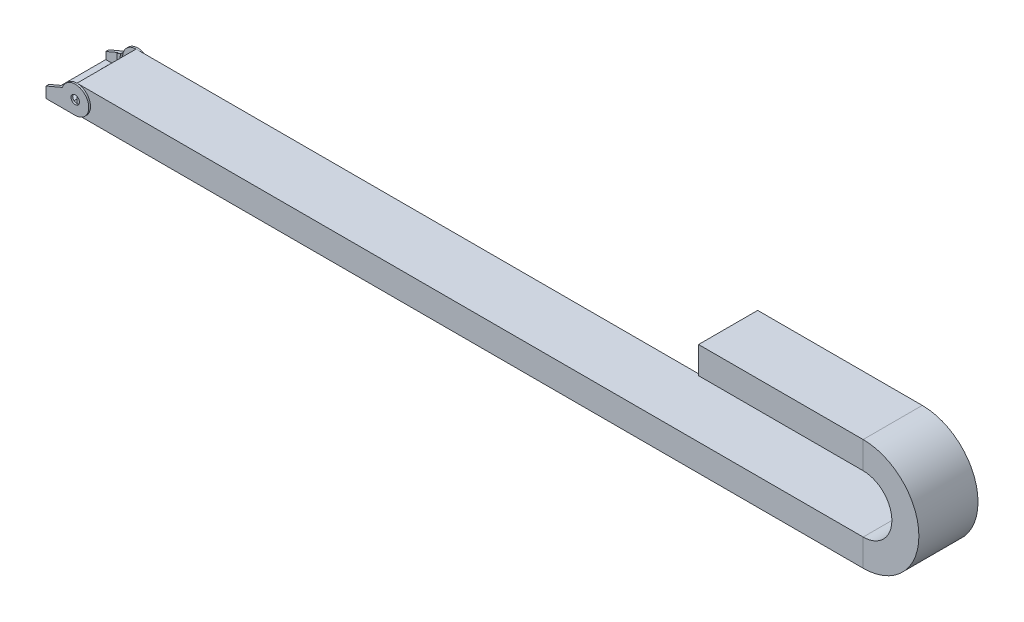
ISO-10303-21;
HEADER;
FILE_DESCRIPTION(('STEP AP214'),'2;1');
FILE_NAME('part.step','',(''),(''),'','','');
FILE_SCHEMA(('AUTOMOTIVE_DESIGN { 1 0 10303 214 1 1 1 1 }'));
ENDSEC;
DATA;
#1=APPLICATION_CONTEXT('core data for automotive mechanical design processes');
#2=APPLICATION_PROTOCOL_DEFINITION('international standard','automotive_design',2000,#1);
#3=PRODUCT_CONTEXT('',#1,'mechanical');
#4=PRODUCT('Part','Part','',(#3));
#5=PRODUCT_RELATED_PRODUCT_CATEGORY('part','',(#4));
#6=PRODUCT_DEFINITION_FORMATION('','',#4);
#7=PRODUCT_DEFINITION_CONTEXT('part definition',#1,'design');
#8=PRODUCT_DEFINITION('design','',#6,#7);
#9=PRODUCT_DEFINITION_SHAPE('','',#8);
#10=(LENGTH_UNIT() NAMED_UNIT(*) SI_UNIT(.MILLI.,.METRE.));
#11=(NAMED_UNIT(*) PLANE_ANGLE_UNIT() SI_UNIT($,.RADIAN.));
#12=(NAMED_UNIT(*) SI_UNIT($,.STERADIAN.) SOLID_ANGLE_UNIT());
#13=UNCERTAINTY_MEASURE_WITH_UNIT(LENGTH_MEASURE(1.E-05),#10,'distance_accuracy_value','');
#14=(GEOMETRIC_REPRESENTATION_CONTEXT(3) GLOBAL_UNCERTAINTY_ASSIGNED_CONTEXT((#13)) GLOBAL_UNIT_ASSIGNED_CONTEXT((#10,
#11,#12)) REPRESENTATION_CONTEXT('',''));
#15=CARTESIAN_POINT('',(0.,0.,0.));
#16=DIRECTION('',(0.,0.,1.));
#17=DIRECTION('',(1.,0.,0.));
#18=AXIS2_PLACEMENT_3D('',#15,#16,#17);
#19=CARTESIAN_POINT('',(0.,0.,54.737));
#20=DIRECTION('',(0.,0.,1.));
#21=DIRECTION('',(1.,0.,0.));
#22=AXIS2_PLACEMENT_3D('',#19,#20,#21);
#23=PLANE('',#22);
#24=DIRECTION('',(0.,-1.,0.));
#25=VECTOR('',#24,1.);
#26=CARTESIAN_POINT('',(-76.2,25.019,54.737));
#27=LINE('',#26,#25);
#28=CARTESIAN_POINT('',(-76.2,-7.874,54.737));
#29=VERTEX_POINT('',#28);
#30=CARTESIAN_POINT('',(-76.2,-25.019,54.737));
#31=VERTEX_POINT('',#30);
#32=EDGE_CURVE('E959',#29,#31,#27,.T.);
#33=ORIENTED_EDGE('',*,*,#32,.T.);
#34=DIRECTION('',(1.,0.,0.));
#35=VECTOR('',#34,1.);
#36=CARTESIAN_POINT('',(-86.6480176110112,-25.019,54.737));
#37=LINE('',#36,#35);
#38=CARTESIAN_POINT('',(-86.6480176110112,-25.019,54.737));
#39=VERTEX_POINT('',#38);
#40=EDGE_CURVE('E439',#39,#31,#37,.T.);
#41=ORIENTED_EDGE('',*,*,#40,.F.);
#42=DIRECTION('',(0.,-1.,0.));
#43=VECTOR('',#42,1.);
#44=CARTESIAN_POINT('',(-86.6480176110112,-22.733,54.737));
#45=LINE('',#44,#43);
#46=CARTESIAN_POINT('',(-86.6480176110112,-22.733,54.737));
#47=VERTEX_POINT('',#46);
#48=EDGE_CURVE('E443',#47,#39,#45,.T.);
#49=ORIENTED_EDGE('',*,*,#48,.F.);
#50=CARTESIAN_POINT('',(-76.2,0.,54.737));
#51=DIRECTION('',(0.,0.,1.));
#52=DIRECTION('',(1.,0.,0.));
#53=AXIS2_PLACEMENT_3D('',#50,#51,#52);
#54=CIRCLE('',#53,25.019);
#55=CARTESIAN_POINT('',(-99.9051547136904,8.001,54.737));
#56=VERTEX_POINT('',#55);
#57=EDGE_CURVE('E448',#56,#47,#54,.T.);
#58=ORIENTED_EDGE('',*,*,#57,.F.);
#59=CARTESIAN_POINT('',(-76.2,25.019,54.737));
#60=VERTEX_POINT('',#59);
#61=EDGE_CURVE('E51',#60,#56,#54,.T.);
#62=ORIENTED_EDGE('',*,*,#61,.F.);
#63=CARTESIAN_POINT('',(-76.2,7.874,54.737));
#64=VERTEX_POINT('',#63);
#65=EDGE_CURVE('E381',#60,#64,#27,.T.);
#66=ORIENTED_EDGE('',*,*,#65,.T.);
#67=CARTESIAN_POINT('',(-76.2,0.,54.737));
#68=DIRECTION('',(0.,0.,1.));
#69=DIRECTION('',(1.,0.,0.));
#70=AXIS2_PLACEMENT_3D('',#67,#68,#69);
#71=CIRCLE('',#70,7.874);
#72=EDGE_CURVE('E424',#64,#29,#71,.T.);
#73=ORIENTED_EDGE('',*,*,#72,.T.);
#74=EDGE_LOOP('',(#33,#41,#49,#58,#62,#66,#73));
#75=FACE_BOUND('',#74,.T.);
#76=ADVANCED_FACE('F35',(#75),#23,.F.);
#77=CARTESIAN_POINT('',(0.,0.,-54.737));
#78=DIRECTION('',(0.,0.,-1.));
#79=DIRECTION('',(1.,0.,0.));
#80=AXIS2_PLACEMENT_3D('',#77,#78,#79);
#81=PLANE('',#80);
#82=DIRECTION('',(0.,1.,0.));
#83=VECTOR('',#82,1.);
#84=CARTESIAN_POINT('',(-76.2,25.019,-54.737));
#85=LINE('',#84,#83);
#86=CARTESIAN_POINT('',(-76.2,7.874,-54.737));
#87=VERTEX_POINT('',#86);
#88=CARTESIAN_POINT('',(-76.2,25.019,-54.737));
#89=VERTEX_POINT('',#88);
#90=EDGE_CURVE('E59',#87,#89,#85,.T.);
#91=ORIENTED_EDGE('',*,*,#90,.T.);
#92=CARTESIAN_POINT('',(-76.2,0.,-54.737));
#93=DIRECTION('',(0.,0.,-1.));
#94=DIRECTION('',(-1.,0.,0.));
#95=AXIS2_PLACEMENT_3D('',#92,#93,#94);
#96=CIRCLE('',#95,25.019);
#97=CARTESIAN_POINT('',(-99.9051547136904,8.001,-54.737));
#98=VERTEX_POINT('',#97);
#99=EDGE_CURVE('E436',#89,#98,#96,.F.);
#100=ORIENTED_EDGE('',*,*,#99,.T.);
#101=CARTESIAN_POINT('',(-86.6480176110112,-22.733,-54.737));
#102=VERTEX_POINT('',#101);
#103=EDGE_CURVE('E437',#98,#102,#96,.F.);
#104=ORIENTED_EDGE('',*,*,#103,.T.);
#105=DIRECTION('',(0.,-1.,0.));
#106=VECTOR('',#105,1.);
#107=CARTESIAN_POINT('',(-86.6480176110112,-22.733,-54.737));
#108=LINE('',#107,#106);
#109=CARTESIAN_POINT('',(-86.6480176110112,-25.019,-54.737));
#110=VERTEX_POINT('',#109);
#111=EDGE_CURVE('E427',#102,#110,#108,.T.);
#112=ORIENTED_EDGE('',*,*,#111,.T.);
#113=DIRECTION('',(1.,0.,0.));
#114=VECTOR('',#113,1.);
#115=CARTESIAN_POINT('',(-86.6480176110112,-25.019,-54.737));
#116=LINE('',#115,#114);
#117=CARTESIAN_POINT('',(-76.2,-25.019,-54.737));
#118=VERTEX_POINT('',#117);
#119=EDGE_CURVE('E431',#110,#118,#116,.T.);
#120=ORIENTED_EDGE('',*,*,#119,.T.);
#121=CARTESIAN_POINT('',(-76.2,-7.874,-54.737));
#122=VERTEX_POINT('',#121);
#123=EDGE_CURVE('E360',#118,#122,#85,.T.);
#124=ORIENTED_EDGE('',*,*,#123,.T.);
#125=CARTESIAN_POINT('',(-76.2,0.,-54.737));
#126=DIRECTION('',(0.,0.,-1.));
#127=DIRECTION('',(-1.,0.,0.));
#128=AXIS2_PLACEMENT_3D('',#125,#126,#127);
#129=CIRCLE('',#128,7.874);
#130=EDGE_CURVE('E421',#122,#87,#129,.T.);
#131=ORIENTED_EDGE('',*,*,#130,.T.);
#132=EDGE_LOOP('',(#91,#100,#104,#112,#120,#124,#131));
#133=FACE_BOUND('',#132,.T.);
#134=ADVANCED_FACE('F734',(#133),#81,.F.);
#135=CARTESIAN_POINT('',(-107.188,-17.907,90.5088962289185));
#136=DIRECTION('',(0.,1.,0.));
#137=DIRECTION('',(0.,0.,1.));
#138=AXIS2_PLACEMENT_3D('',#135,#136,#137);
#139=PLANE('',#138);
#140=DIRECTION('',(0.,0.,-1.));
#141=VECTOR('',#140,1.);
#142=CARTESIAN_POINT('',(-107.188,-17.907,45.72));
#143=LINE('',#142,#141);
#144=CARTESIAN_POINT('',(-107.188,-17.907,45.72));
#145=VERTEX_POINT('',#144);
#146=CARTESIAN_POINT('',(-107.188,-17.907,34.29));
#147=VERTEX_POINT('',#146);
#148=EDGE_CURVE('E522',#145,#147,#143,.T.);
#149=ORIENTED_EDGE('',*,*,#148,.F.);
#150=CARTESIAN_POINT('',(-113.284,-17.907,45.72));
#151=DIRECTION('',(0.,-1.,0.));
#152=DIRECTION('',(0.,0.,1.));
#153=AXIS2_PLACEMENT_3D('',#150,#151,#152);
#154=CIRCLE('',#153,6.09600000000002);
#155=CARTESIAN_POINT('',(-119.38,-17.907,45.72));
#156=VERTEX_POINT('',#155);
#157=EDGE_CURVE('E531',#156,#145,#154,.F.);
#158=ORIENTED_EDGE('',*,*,#157,.F.);
#159=DIRECTION('',(0.,0.,1.));
#160=VECTOR('',#159,1.);
#161=CARTESIAN_POINT('',(-119.38,-17.907,34.29));
#162=LINE('',#161,#160);
#163=CARTESIAN_POINT('',(-119.38,-17.907,34.29));
#164=VERTEX_POINT('',#163);
#165=EDGE_CURVE('E536',#164,#156,#162,.T.);
#166=ORIENTED_EDGE('',*,*,#165,.F.);
#167=CARTESIAN_POINT('',(-113.284,-17.907,34.29));
#168=DIRECTION('',(0.,-1.,0.));
#169=DIRECTION('',(0.,0.,1.));
#170=AXIS2_PLACEMENT_3D('',#167,#168,#169);
#171=CIRCLE('',#170,6.09600000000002);
#172=EDGE_CURVE('E540',#147,#164,#171,.F.);
#173=ORIENTED_EDGE('',*,*,#172,.F.);
#174=EDGE_LOOP('',(#149,#158,#166,#173));
#175=FACE_BOUND('',#174,.T.);
#176=DIRECTION('',(0.,0.,-1.));
#177=VECTOR('',#176,1.);
#178=CARTESIAN_POINT('',(-107.188,-17.907,-45.72));
#179=LINE('',#178,#177);
#180=CARTESIAN_POINT('',(-107.188,-17.907,-45.72));
#181=VERTEX_POINT('',#180);
#182=CARTESIAN_POINT('',(-107.188,-17.907,-34.29));
#183=VERTEX_POINT('',#182);
#184=EDGE_CURVE('E480',#181,#183,#179,.F.);
#185=ORIENTED_EDGE('',*,*,#184,.T.);
#186=CARTESIAN_POINT('',(-113.284,-17.907,-34.29));
#187=DIRECTION('',(0.,-1.,0.));
#188=DIRECTION('',(0.,0.,1.));
#189=AXIS2_PLACEMENT_3D('',#186,#187,#188);
#190=CIRCLE('',#189,6.09600000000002);
#191=CARTESIAN_POINT('',(-119.38,-17.907,-34.29));
#192=VERTEX_POINT('',#191);
#193=EDGE_CURVE('E476',#183,#192,#190,.T.);
#194=ORIENTED_EDGE('',*,*,#193,.T.);
#195=DIRECTION('',(0.,0.,1.));
#196=VECTOR('',#195,1.);
#197=CARTESIAN_POINT('',(-119.38,-17.907,-34.29));
#198=LINE('',#197,#196);
#199=CARTESIAN_POINT('',(-119.38,-17.907,-45.72));
#200=VERTEX_POINT('',#199);
#201=EDGE_CURVE('E486',#192,#200,#198,.F.);
#202=ORIENTED_EDGE('',*,*,#201,.T.);
#203=CARTESIAN_POINT('',(-113.284,-17.907,-45.72));
#204=DIRECTION('',(0.,-1.,0.));
#205=DIRECTION('',(0.,0.,1.));
#206=AXIS2_PLACEMENT_3D('',#203,#204,#205);
#207=CIRCLE('',#206,6.09600000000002);
#208=EDGE_CURVE('E483',#200,#181,#207,.T.);
#209=ORIENTED_EDGE('',*,*,#208,.T.);
#210=EDGE_LOOP('',(#185,#194,#202,#209));
#211=FACE_BOUND('',#210,.T.);
#212=DIRECTION('',(-1.,0.,0.));
#213=VECTOR('',#212,1.);
#214=CARTESIAN_POINT('',(-90.424,-17.907,50.038));
#215=LINE('',#214,#213);
#216=CARTESIAN_POINT('',(-93.6725416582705,-17.907,50.038));
#217=VERTEX_POINT('',#216);
#218=CARTESIAN_POINT('',(-107.188,-17.907,50.038));
#219=VERTEX_POINT('',#218);
#220=EDGE_CURVE('E623',#217,#219,#215,.T.);
#221=ORIENTED_EDGE('',*,*,#220,.F.);
#222=DIRECTION('',(0.,0.,-1.));
#223=VECTOR('',#222,1.);
#224=CARTESIAN_POINT('',(-93.6725416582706,-17.907,125.501418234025));
#225=LINE('',#224,#223);
#226=CARTESIAN_POINT('',(-93.6725416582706,-17.907,-50.038));
#227=VERTEX_POINT('',#226);
#228=EDGE_CURVE('E442',#217,#227,#225,.T.);
#229=ORIENTED_EDGE('',*,*,#228,.T.);
#230=DIRECTION('',(-1.,0.,0.));
#231=VECTOR('',#230,1.);
#232=CARTESIAN_POINT('',(-90.424,-17.907,-50.038));
#233=LINE('',#232,#231);
#234=CARTESIAN_POINT('',(-107.188,-17.907,-50.038));
#235=VERTEX_POINT('',#234);
#236=EDGE_CURVE('E613',#227,#235,#233,.T.);
#237=ORIENTED_EDGE('',*,*,#236,.T.);
#238=DIRECTION('',(0.,0.,-1.));
#239=VECTOR('',#238,1.);
#240=CARTESIAN_POINT('',(-107.188,-17.907,90.5088962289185));
#241=LINE('',#240,#239);
#242=CARTESIAN_POINT('',(-107.188,-17.907,-52.705));
#243=VERTEX_POINT('',#242);
#244=EDGE_CURVE('E662',#235,#243,#241,.T.);
#245=ORIENTED_EDGE('',*,*,#244,.T.);
#246=DIRECTION('',(1.,0.,0.));
#247=VECTOR('',#246,1.);
#248=CARTESIAN_POINT('',(-107.188,-17.907,-52.705));
#249=LINE('',#248,#247);
#250=CARTESIAN_POINT('',(-130.302,-17.907,-52.705));
#251=VERTEX_POINT('',#250);
#252=EDGE_CURVE('E635',#251,#243,#249,.T.);
#253=ORIENTED_EDGE('',*,*,#252,.F.);
#254=DIRECTION('',(0.,0.,-1.));
#255=VECTOR('',#254,1.);
#256=CARTESIAN_POINT('',(-130.302,-17.907,90.5088962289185));
#257=LINE('',#256,#255);
#258=CARTESIAN_POINT('',(-130.302,-17.907,52.705));
#259=VERTEX_POINT('',#258);
#260=EDGE_CURVE('E658',#259,#251,#257,.T.);
#261=ORIENTED_EDGE('',*,*,#260,.F.);
#262=DIRECTION('',(-1.,0.,0.));
#263=VECTOR('',#262,1.);
#264=CARTESIAN_POINT('',(-107.188,-17.907,52.705));
#265=LINE('',#264,#263);
#266=CARTESIAN_POINT('',(-107.188,-17.907,52.705));
#267=VERTEX_POINT('',#266);
#268=EDGE_CURVE('E646',#267,#259,#265,.T.);
#269=ORIENTED_EDGE('',*,*,#268,.F.);
#270=EDGE_CURVE('E663',#267,#219,#241,.T.);
#271=ORIENTED_EDGE('',*,*,#270,.T.);
#272=EDGE_LOOP('',(#221,#229,#237,#245,#253,#261,#269,#271));
#273=FACE_BOUND('',#272,.T.);
#274=ADVANCED_FACE('F792',(#175,#211,#273),#139,.T.);
#275=CARTESIAN_POINT('',(-76.2,-25.019,58.039));
#276=DIRECTION('',(0.,1.,0.));
#277=DIRECTION('',(0.,0.,1.));
#278=AXIS2_PLACEMENT_3D('',#275,#276,#277);
#279=PLANE('',#278);
#280=DIRECTION('',(0.,0.,-1.));
#281=VECTOR('',#280,1.);
#282=CARTESIAN_POINT('',(-110.236,-25.019,45.72));
#283=LINE('',#282,#281);
#284=CARTESIAN_POINT('',(-110.236,-25.019,45.72));
#285=VERTEX_POINT('',#284);
#286=CARTESIAN_POINT('',(-110.236,-25.019,34.29));
#287=VERTEX_POINT('',#286);
#288=EDGE_CURVE('E564',#285,#287,#283,.T.);
#289=ORIENTED_EDGE('',*,*,#288,.T.);
#290=CARTESIAN_POINT('',(-113.284,-25.019,34.29));
#291=DIRECTION('',(0.,1.,0.));
#292=DIRECTION('',(0.,0.,-1.));
#293=AXIS2_PLACEMENT_3D('',#290,#291,#292);
#294=CIRCLE('',#293,3.04800000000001);
#295=CARTESIAN_POINT('',(-116.332,-25.019,34.29));
#296=VERTEX_POINT('',#295);
#297=EDGE_CURVE('E567',#287,#296,#294,.T.);
#298=ORIENTED_EDGE('',*,*,#297,.T.);
#299=DIRECTION('',(0.,0.,1.));
#300=VECTOR('',#299,1.);
#301=CARTESIAN_POINT('',(-116.332,-25.019,45.72));
#302=LINE('',#301,#300);
#303=CARTESIAN_POINT('',(-116.332,-25.019,45.72));
#304=VERTEX_POINT('',#303);
#305=EDGE_CURVE('E552',#296,#304,#302,.T.);
#306=ORIENTED_EDGE('',*,*,#305,.T.);
#307=CARTESIAN_POINT('',(-113.284,-25.019,45.72));
#308=DIRECTION('',(0.,1.,0.));
#309=DIRECTION('',(0.,0.,-1.));
#310=AXIS2_PLACEMENT_3D('',#307,#308,#309);
#311=CIRCLE('',#310,3.04800000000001);
#312=EDGE_CURVE('E547',#304,#285,#311,.T.);
#313=ORIENTED_EDGE('',*,*,#312,.T.);
#314=EDGE_LOOP('',(#289,#298,#306,#313));
#315=FACE_BOUND('',#314,.T.);
#316=CARTESIAN_POINT('',(-113.284,-25.019,-45.72));
#317=DIRECTION('',(0.,-1.,0.));
#318=DIRECTION('',(0.,0.,1.));
#319=AXIS2_PLACEMENT_3D('',#316,#317,#318);
#320=CIRCLE('',#319,3.04800000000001);
#321=CARTESIAN_POINT('',(-116.332,-25.019,-45.72));
#322=VERTEX_POINT('',#321);
#323=CARTESIAN_POINT('',(-110.236,-25.019,-45.72));
#324=VERTEX_POINT('',#323);
#325=EDGE_CURVE('E479',#322,#324,#320,.T.);
#326=ORIENTED_EDGE('',*,*,#325,.F.);
#327=DIRECTION('',(0.,0.,-1.));
#328=VECTOR('',#327,1.);
#329=CARTESIAN_POINT('',(-116.332,-25.019,-45.72));
#330=LINE('',#329,#328);
#331=CARTESIAN_POINT('',(-116.332,-25.019,-34.29));
#332=VERTEX_POINT('',#331);
#333=EDGE_CURVE('E512',#332,#322,#330,.T.);
#334=ORIENTED_EDGE('',*,*,#333,.F.);
#335=CARTESIAN_POINT('',(-113.284,-25.019,-34.29));
#336=DIRECTION('',(0.,-1.,0.));
#337=DIRECTION('',(0.,0.,1.));
#338=AXIS2_PLACEMENT_3D('',#335,#336,#337);
#339=CIRCLE('',#338,3.04800000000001);
#340=CARTESIAN_POINT('',(-110.236,-25.019,-34.29));
#341=VERTEX_POINT('',#340);
#342=EDGE_CURVE('E515',#341,#332,#339,.T.);
#343=ORIENTED_EDGE('',*,*,#342,.F.);
#344=DIRECTION('',(0.,0.,1.));
#345=VECTOR('',#344,1.);
#346=CARTESIAN_POINT('',(-110.236,-25.019,-45.72));
#347=LINE('',#346,#345);
#348=EDGE_CURVE('E500',#324,#341,#347,.T.);
#349=ORIENTED_EDGE('',*,*,#348,.F.);
#350=EDGE_LOOP('',(#326,#334,#343,#349));
#351=FACE_BOUND('',#350,.T.);
#352=DIRECTION('',(0.,0.,-1.));
#353=VECTOR('',#352,1.);
#354=CARTESIAN_POINT('',(-86.6480176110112,-25.019,125.501418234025));
#355=LINE('',#354,#353);
#356=CARTESIAN_POINT('',(-86.6480176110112,-25.019,50.038));
#357=VERTEX_POINT('',#356);
#358=EDGE_CURVE('E453',#39,#357,#355,.T.);
#359=ORIENTED_EDGE('',*,*,#358,.F.);
#360=ORIENTED_EDGE('',*,*,#40,.T.);
#361=DIRECTION('',(0.,0.,-1.));
#362=VECTOR('',#361,1.);
#363=CARTESIAN_POINT('',(-76.2,-25.019,58.039));
#364=LINE('',#363,#362);
#365=CARTESIAN_POINT('',(-76.2,-25.019,58.039));
#366=VERTEX_POINT('',#365);
#367=EDGE_CURVE('E699',#366,#31,#364,.T.);
#368=ORIENTED_EDGE('',*,*,#367,.F.);
#369=DIRECTION('',(-1.,0.,0.));
#370=VECTOR('',#369,1.);
#371=CARTESIAN_POINT('',(-76.2,-25.019,58.039));
#372=LINE('',#371,#370);
#373=CARTESIAN_POINT('',(-130.302,-25.019,58.039));
#374=VERTEX_POINT('',#373);
#375=EDGE_CURVE('E668',#366,#374,#372,.T.);
#376=ORIENTED_EDGE('',*,*,#375,.T.);
#377=DIRECTION('',(0.,0.,-1.));
#378=VECTOR('',#377,1.);
#379=CARTESIAN_POINT('',(-130.302,-25.019,58.039));
#380=LINE('',#379,#378);
#381=CARTESIAN_POINT('',(-130.302,-25.019,52.705));
#382=VERTEX_POINT('',#381);
#383=EDGE_CURVE('E695',#374,#382,#380,.T.);
#384=ORIENTED_EDGE('',*,*,#383,.T.);
#385=DIRECTION('',(1.,0.,0.));
#386=VECTOR('',#385,1.);
#387=CARTESIAN_POINT('',(-120.396,-25.019,52.705));
#388=LINE('',#387,#386);
#389=CARTESIAN_POINT('',(-120.396,-25.019,52.705));
#390=VERTEX_POINT('',#389);
#391=EDGE_CURVE('E584',#382,#390,#388,.T.);
#392=ORIENTED_EDGE('',*,*,#391,.T.);
#393=DIRECTION('',(0.,0.,-1.));
#394=VECTOR('',#393,1.);
#395=CARTESIAN_POINT('',(-120.396,-25.019,-52.705));
#396=LINE('',#395,#394);
#397=CARTESIAN_POINT('',(-120.396,-25.019,-52.705));
#398=VERTEX_POINT('',#397);
#399=EDGE_CURVE('E574',#390,#398,#396,.T.);
#400=ORIENTED_EDGE('',*,*,#399,.T.);
#401=DIRECTION('',(-1.,0.,0.));
#402=VECTOR('',#401,1.);
#403=CARTESIAN_POINT('',(-120.396,-25.019,-52.705));
#404=LINE('',#403,#402);
#405=CARTESIAN_POINT('',(-130.302,-25.019,-52.705));
#406=VERTEX_POINT('',#405);
#407=EDGE_CURVE('E594',#398,#406,#404,.T.);
#408=ORIENTED_EDGE('',*,*,#407,.T.);
#409=CARTESIAN_POINT('',(-130.302,-25.019,-58.039));
#410=VERTEX_POINT('',#409);
#411=EDGE_CURVE('E694',#406,#410,#380,.T.);
#412=ORIENTED_EDGE('',*,*,#411,.T.);
#413=DIRECTION('',(-1.,0.,0.));
#414=VECTOR('',#413,1.);
#415=CARTESIAN_POINT('',(-76.2,-25.019,-58.039));
#416=LINE('',#415,#414);
#417=CARTESIAN_POINT('',(-76.2,-25.019,-58.039));
#418=VERTEX_POINT('',#417);
#419=EDGE_CURVE('E649',#418,#410,#416,.T.);
#420=ORIENTED_EDGE('',*,*,#419,.F.);
#421=EDGE_CURVE('E698',#118,#418,#364,.T.);
#422=ORIENTED_EDGE('',*,*,#421,.F.);
#423=ORIENTED_EDGE('',*,*,#119,.F.);
#424=CARTESIAN_POINT('',(-86.6480176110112,-25.019,-50.038));
#425=VERTEX_POINT('',#424);
#426=EDGE_CURVE('E452',#425,#110,#355,.T.);
#427=ORIENTED_EDGE('',*,*,#426,.F.);
#428=DIRECTION('',(-1.,0.,0.));
#429=VECTOR('',#428,1.);
#430=CARTESIAN_POINT('',(-76.2,-25.019,-50.038));
#431=LINE('',#430,#429);
#432=CARTESIAN_POINT('',(-90.424,-25.019,-50.038));
#433=VERTEX_POINT('',#432);
#434=EDGE_CURVE('E607',#425,#433,#431,.T.);
#435=ORIENTED_EDGE('',*,*,#434,.T.);
#436=DIRECTION('',(0.,0.,1.));
#437=VECTOR('',#436,1.);
#438=CARTESIAN_POINT('',(-90.424,-25.019,-50.038));
#439=LINE('',#438,#437);
#440=CARTESIAN_POINT('',(-90.424,-25.019,50.038));
#441=VERTEX_POINT('',#440);
#442=EDGE_CURVE('E618',#433,#441,#439,.T.);
#443=ORIENTED_EDGE('',*,*,#442,.T.);
#444=DIRECTION('',(-1.,0.,0.));
#445=VECTOR('',#444,1.);
#446=CARTESIAN_POINT('',(-76.2,-25.019,50.038));
#447=LINE('',#446,#445);
#448=EDGE_CURVE('E601',#357,#441,#447,.T.);
#449=ORIENTED_EDGE('',*,*,#448,.F.);
#450=EDGE_LOOP('',(#359,#360,#368,#376,#384,#392,#400,#408,#412,#420,#422,#423,#427,#435,#443,#449));
#451=FACE_BOUND('',#450,.T.);
#452=ADVANCED_FACE('F722',(#315,#351,#451),#279,.F.);
#453=CARTESIAN_POINT('',(-90.424,-25.019,-50.038));
#454=DIRECTION('',(-1.,0.,0.));
#455=DIRECTION('',(0.,0.,-1.));
#456=AXIS2_PLACEMENT_3D('',#453,#454,#455);
#457=PLANE('',#456);
#458=DIRECTION('',(0.,0.,-1.));
#459=VECTOR('',#458,1.);
#460=CARTESIAN_POINT('',(-90.424,-20.5822298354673,125.501418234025));
#461=LINE('',#460,#459);
#462=CARTESIAN_POINT('',(-90.424,-20.5822298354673,50.038));
#463=VERTEX_POINT('',#462);
#464=CARTESIAN_POINT('',(-90.424,-20.5822298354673,-50.038));
#465=VERTEX_POINT('',#464);
#466=EDGE_CURVE('E460',#463,#465,#461,.T.);
#467=ORIENTED_EDGE('',*,*,#466,.F.);
#468=DIRECTION('',(0.,1.,0.));
#469=VECTOR('',#468,1.);
#470=CARTESIAN_POINT('',(-90.424,-25.019,50.038));
#471=LINE('',#470,#469);
#472=EDGE_CURVE('E620',#441,#463,#471,.T.);
#473=ORIENTED_EDGE('',*,*,#472,.F.);
#474=ORIENTED_EDGE('',*,*,#442,.F.);
#475=DIRECTION('',(0.,1.,0.));
#476=VECTOR('',#475,1.);
#477=CARTESIAN_POINT('',(-90.424,-25.019,-50.038));
#478=LINE('',#477,#476);
#479=EDGE_CURVE('E609',#433,#465,#478,.T.);
#480=ORIENTED_EDGE('',*,*,#479,.T.);
#481=EDGE_LOOP('',(#467,#473,#474,#480));
#482=FACE_BOUND('',#481,.T.);
#483=ADVANCED_FACE('F715',(#482),#457,.F.);
#484=CARTESIAN_POINT('',(-76.2,0.,-50.038));
#485=DIRECTION('',(0.,0.,1.));
#486=DIRECTION('',(-1.,0.,0.));
#487=AXIS2_PLACEMENT_3D('',#484,#485,#486);
#488=PLANE('',#487);
#489=ORIENTED_EDGE('',*,*,#434,.F.);
#490=DIRECTION('',(0.,1.,0.));
#491=VECTOR('',#490,1.);
#492=CARTESIAN_POINT('',(-86.6480176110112,0.,-50.038));
#493=LINE('',#492,#491);
#494=CARTESIAN_POINT('',(-86.6480176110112,-22.733,-50.038));
#495=VERTEX_POINT('',#494);
#496=EDGE_CURVE('E466',#425,#495,#493,.T.);
#497=ORIENTED_EDGE('',*,*,#496,.T.);
#498=CARTESIAN_POINT('',(-76.2,0.,-50.038));
#499=DIRECTION('',(0.,0.,1.));
#500=DIRECTION('',(1.,0.,0.));
#501=AXIS2_PLACEMENT_3D('',#498,#499,#500);
#502=CIRCLE('',#501,25.019);
#503=EDGE_CURVE('E461',#495,#465,#502,.F.);
#504=ORIENTED_EDGE('',*,*,#503,.T.);
#505=ORIENTED_EDGE('',*,*,#479,.F.);
#506=EDGE_LOOP('',(#489,#497,#504,#505));
#507=FACE_BOUND('',#506,.T.);
#508=ADVANCED_FACE('F727',(#507),#488,.T.);
#509=ORIENTED_EDGE('',*,*,#236,.F.);
#510=CARTESIAN_POINT('',(-99.9051547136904,8.001,-50.038));
#511=VERTEX_POINT('',#510);
#512=EDGE_CURVE('E457',#227,#511,#502,.F.);
#513=ORIENTED_EDGE('',*,*,#512,.T.);
#514=DIRECTION('',(0.919945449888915,0.392046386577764,0.));
#515=VECTOR('',#514,1.);
#516=CARTESIAN_POINT('',(-130.302,-4.953,-50.038));
#517=LINE('',#516,#515);
#518=CARTESIAN_POINT('',(-107.188,4.89732338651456,-50.038));
#519=VERTEX_POINT('',#518);
#520=EDGE_CURVE('E615',#519,#511,#517,.T.);
#521=ORIENTED_EDGE('',*,*,#520,.F.);
#522=DIRECTION('',(0.,-1.,0.));
#523=VECTOR('',#522,1.);
#524=CARTESIAN_POINT('',(-107.188,4.89732338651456,-50.038));
#525=LINE('',#524,#523);
#526=EDGE_CURVE('E632',#519,#235,#525,.T.);
#527=ORIENTED_EDGE('',*,*,#526,.T.);
#528=EDGE_LOOP('',(#509,#513,#521,#527));
#529=FACE_BOUND('',#528,.T.);
#530=ADVANCED_FACE('F881',(#529),#488,.T.);
#531=CARTESIAN_POINT('',(-76.2,0.,50.038));
#532=DIRECTION('',(0.,0.,1.));
#533=DIRECTION('',(-1.,0.,0.));
#534=AXIS2_PLACEMENT_3D('',#531,#532,#533);
#535=PLANE('',#534);
#536=DIRECTION('',(0.,1.,0.));
#537=VECTOR('',#536,1.);
#538=CARTESIAN_POINT('',(-86.6480176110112,0.,50.038));
#539=LINE('',#538,#537);
#540=CARTESIAN_POINT('',(-86.6480176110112,-22.733,50.038));
#541=VERTEX_POINT('',#540);
#542=EDGE_CURVE('E12',#357,#541,#539,.T.);
#543=ORIENTED_EDGE('',*,*,#542,.F.);
#544=ORIENTED_EDGE('',*,*,#448,.T.);
#545=ORIENTED_EDGE('',*,*,#472,.T.);
#546=CARTESIAN_POINT('',(-76.2,0.,50.038));
#547=DIRECTION('',(0.,0.,1.));
#548=DIRECTION('',(1.,0.,0.));
#549=AXIS2_PLACEMENT_3D('',#546,#547,#548);
#550=CIRCLE('',#549,25.019);
#551=EDGE_CURVE('E44',#541,#463,#550,.F.);
#552=ORIENTED_EDGE('',*,*,#551,.F.);
#553=EDGE_LOOP('',(#543,#544,#545,#552));
#554=FACE_BOUND('',#553,.T.);
#555=ADVANCED_FACE('F718',(#554),#535,.F.);
#556=CARTESIAN_POINT('',(-99.9051547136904,8.001,50.038));
#557=VERTEX_POINT('',#556);
#558=EDGE_CURVE('E702',#217,#557,#550,.F.);
#559=ORIENTED_EDGE('',*,*,#558,.F.);
#560=ORIENTED_EDGE('',*,*,#220,.T.);
#561=DIRECTION('',(0.,-1.,0.));
#562=VECTOR('',#561,1.);
#563=CARTESIAN_POINT('',(-107.188,4.89732338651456,50.038));
#564=LINE('',#563,#562);
#565=CARTESIAN_POINT('',(-107.188,4.89732338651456,50.038));
#566=VERTEX_POINT('',#565);
#567=EDGE_CURVE('E629',#566,#219,#564,.T.);
#568=ORIENTED_EDGE('',*,*,#567,.F.);
#569=DIRECTION('',(0.919945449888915,0.392046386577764,0.));
#570=VECTOR('',#569,1.);
#571=CARTESIAN_POINT('',(-130.302,-4.953,50.038));
#572=LINE('',#571,#570);
#573=EDGE_CURVE('E610',#566,#557,#572,.T.);
#574=ORIENTED_EDGE('',*,*,#573,.T.);
#575=EDGE_LOOP('',(#559,#560,#568,#574));
#576=FACE_BOUND('',#575,.T.);
#577=ADVANCED_FACE('F884',(#576),#535,.F.);
#578=CARTESIAN_POINT('',(-76.2,0.,58.039));
#579=DIRECTION('',(0.,0.,-1.));
#580=DIRECTION('',(1.,0.,0.));
#581=AXIS2_PLACEMENT_3D('',#578,#579,#580);
#582=CYLINDRICAL_SURFACE('',#581,25.019);
#583=DIRECTION('',(0.,0.,-1.));
#584=VECTOR('',#583,1.);
#585=CARTESIAN_POINT('',(-99.9051547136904,8.001,58.039));
#586=LINE('',#585,#584);
#587=CARTESIAN_POINT('',(-99.9051547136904,8.001,-58.039));
#588=VERTEX_POINT('',#587);
#589=EDGE_CURVE('E678',#98,#588,#586,.T.);
#590=ORIENTED_EDGE('',*,*,#589,.F.);
#591=ORIENTED_EDGE('',*,*,#99,.F.);
#592=EDGE_CURVE('E432',#118,#89,#96,.F.);
#593=ORIENTED_EDGE('',*,*,#592,.F.);
#594=ORIENTED_EDGE('',*,*,#421,.T.);
#595=CARTESIAN_POINT('',(-76.2,0.,-58.039));
#596=DIRECTION('',(0.,0.,1.));
#597=DIRECTION('',(1.,0.,0.));
#598=AXIS2_PLACEMENT_3D('',#595,#596,#597);
#599=CIRCLE('',#598,25.019);
#600=EDGE_CURVE('E469',#418,#588,#599,.T.);
#601=ORIENTED_EDGE('',*,*,#600,.T.);
#602=EDGE_LOOP('',(#590,#591,#593,#594,#601));
#603=FACE_BOUND('',#602,.T.);
#604=ADVANCED_FACE('F975',(#603),#582,.T.);
#605=ORIENTED_EDGE('',*,*,#367,.T.);
#606=EDGE_CURVE('E446',#31,#60,#54,.T.);
#607=ORIENTED_EDGE('',*,*,#606,.T.);
#608=ORIENTED_EDGE('',*,*,#61,.T.);
#609=CARTESIAN_POINT('',(-99.9051547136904,8.001,58.039));
#610=VERTEX_POINT('',#609);
#611=EDGE_CURVE('E686',#610,#56,#586,.T.);
#612=ORIENTED_EDGE('',*,*,#611,.F.);
#613=CARTESIAN_POINT('',(-76.2,0.,58.039));
#614=DIRECTION('',(0.,0.,1.));
#615=DIRECTION('',(1.,0.,0.));
#616=AXIS2_PLACEMENT_3D('',#613,#614,#615);
#617=CIRCLE('',#616,25.019);
#618=EDGE_CURVE('E472',#366,#610,#617,.T.);
#619=ORIENTED_EDGE('',*,*,#618,.F.);
#620=EDGE_LOOP('',(#605,#607,#608,#612,#619));
#621=FACE_BOUND('',#620,.T.);
#622=ADVANCED_FACE('F37',(#621),#582,.T.);
#623=CARTESIAN_POINT('',(-130.302,-4.953,58.039));
#624=DIRECTION('',(0.392046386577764,-0.919945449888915,0.));
#625=DIRECTION('',(-0.919945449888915,-0.392046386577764,0.));
#626=AXIS2_PLACEMENT_3D('',#623,#624,#625);
#627=PLANE('',#626);
#628=ORIENTED_EDGE('',*,*,#520,.T.);
#629=EDGE_CURVE('E690',#511,#98,#586,.T.);
#630=ORIENTED_EDGE('',*,*,#629,.T.);
#631=ORIENTED_EDGE('',*,*,#589,.T.);
#632=DIRECTION('',(0.919945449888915,0.392046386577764,0.));
#633=VECTOR('',#632,1.);
#634=CARTESIAN_POINT('',(-130.302,-4.953,-58.039));
#635=LINE('',#634,#633);
#636=CARTESIAN_POINT('',(-130.302,-4.953,-58.039));
#637=VERTEX_POINT('',#636);
#638=EDGE_CURVE('E672',#637,#588,#635,.T.);
#639=ORIENTED_EDGE('',*,*,#638,.F.);
#640=DIRECTION('',(0.,0.,-1.));
#641=VECTOR('',#640,1.);
#642=CARTESIAN_POINT('',(-130.302,-4.953,58.039));
#643=LINE('',#642,#641);
#644=CARTESIAN_POINT('',(-130.302,-4.953,-52.705));
#645=VERTEX_POINT('',#644);
#646=EDGE_CURVE('E689',#645,#637,#643,.T.);
#647=ORIENTED_EDGE('',*,*,#646,.F.);
#648=DIRECTION('',(-0.919945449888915,-0.392046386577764,0.));
#649=VECTOR('',#648,1.);
#650=CARTESIAN_POINT('',(-130.302,-4.953,-52.705));
#651=LINE('',#650,#649);
#652=CARTESIAN_POINT('',(-107.188,4.89732338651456,-52.705));
#653=VERTEX_POINT('',#652);
#654=EDGE_CURVE('E640',#653,#645,#651,.T.);
#655=ORIENTED_EDGE('',*,*,#654,.F.);
#656=DIRECTION('',(0.,0.,-1.));
#657=VECTOR('',#656,1.);
#658=CARTESIAN_POINT('',(-107.188,4.89732338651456,90.5088962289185));
#659=LINE('',#658,#657);
#660=EDGE_CURVE('E645',#519,#653,#659,.T.);
#661=ORIENTED_EDGE('',*,*,#660,.F.);
#662=EDGE_LOOP('',(#628,#630,#631,#639,#647,#655,#661));
#663=FACE_BOUND('',#662,.T.);
#664=ADVANCED_FACE('F915',(#663),#627,.F.);
#665=CARTESIAN_POINT('',(-107.188,4.89732338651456,90.5088962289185));
#666=DIRECTION('',(-1.,0.,0.));
#667=DIRECTION('',(0.,1.,0.));
#668=AXIS2_PLACEMENT_3D('',#665,#666,#667);
#669=PLANE('',#668);
#670=ORIENTED_EDGE('',*,*,#660,.T.);
#671=DIRECTION('',(0.,1.,0.));
#672=VECTOR('',#671,1.);
#673=CARTESIAN_POINT('',(-107.188,4.89732338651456,-52.705));
#674=LINE('',#673,#672);
#675=EDGE_CURVE('E643',#243,#653,#674,.T.);
#676=ORIENTED_EDGE('',*,*,#675,.F.);
#677=ORIENTED_EDGE('',*,*,#244,.F.);
#678=ORIENTED_EDGE('',*,*,#526,.F.);
#679=EDGE_LOOP('',(#670,#676,#677,#678));
#680=FACE_BOUND('',#679,.T.);
#681=ADVANCED_FACE('F899',(#680),#669,.T.);
#682=CARTESIAN_POINT('',(-130.302,-25.019,58.039));
#683=DIRECTION('',(1.,0.,0.));
#684=DIRECTION('',(0.,0.,1.));
#685=AXIS2_PLACEMENT_3D('',#682,#683,#684);
#686=PLANE('',#685);
#687=ORIENTED_EDGE('',*,*,#383,.F.);
#688=DIRECTION('',(0.,1.,0.));
#689=VECTOR('',#688,1.);
#690=CARTESIAN_POINT('',(-130.302,-25.019,58.039));
#691=LINE('',#690,#689);
#692=CARTESIAN_POINT('',(-130.302,-4.953,58.039));
#693=VERTEX_POINT('',#692);
#694=EDGE_CURVE('E671',#374,#693,#691,.T.);
#695=ORIENTED_EDGE('',*,*,#694,.T.);
#696=CARTESIAN_POINT('',(-130.302,-4.953,52.705));
#697=VERTEX_POINT('',#696);
#698=EDGE_CURVE('E691',#693,#697,#643,.T.);
#699=ORIENTED_EDGE('',*,*,#698,.T.);
#700=DIRECTION('',(0.,1.,0.));
#701=VECTOR('',#700,1.);
#702=CARTESIAN_POINT('',(-130.302,-17.907,52.705));
#703=LINE('',#702,#701);
#704=EDGE_CURVE('E655',#259,#697,#703,.T.);
#705=ORIENTED_EDGE('',*,*,#704,.F.);
#706=ORIENTED_EDGE('',*,*,#260,.T.);
#707=DIRECTION('',(0.,-1.,0.));
#708=VECTOR('',#707,1.);
#709=CARTESIAN_POINT('',(-130.302,-17.907,-52.705));
#710=LINE('',#709,#708);
#711=EDGE_CURVE('E638',#645,#251,#710,.T.);
#712=ORIENTED_EDGE('',*,*,#711,.F.);
#713=ORIENTED_EDGE('',*,*,#646,.T.);
#714=DIRECTION('',(0.,1.,0.));
#715=VECTOR('',#714,1.);
#716=CARTESIAN_POINT('',(-130.302,-25.019,-58.039));
#717=LINE('',#716,#715);
#718=EDGE_CURVE('E681',#410,#637,#717,.T.);
#719=ORIENTED_EDGE('',*,*,#718,.F.);
#720=ORIENTED_EDGE('',*,*,#411,.F.);
#721=DIRECTION('',(0.,-1.,0.));
#722=VECTOR('',#721,1.);
#723=CARTESIAN_POINT('',(-130.302,-22.987,-52.705));
#724=LINE('',#723,#722);
#725=CARTESIAN_POINT('',(-130.302,-22.987,-52.705));
#726=VERTEX_POINT('',#725);
#727=EDGE_CURVE('E604',#726,#406,#724,.T.);
#728=ORIENTED_EDGE('',*,*,#727,.F.);
#729=DIRECTION('',(0.,0.,1.));
#730=VECTOR('',#729,1.);
#731=CARTESIAN_POINT('',(-130.302,-22.987,-52.705));
#732=LINE('',#731,#730);
#733=CARTESIAN_POINT('',(-130.302,-22.987,52.705));
#734=VERTEX_POINT('',#733);
#735=EDGE_CURVE('E586',#726,#734,#732,.T.);
#736=ORIENTED_EDGE('',*,*,#735,.T.);
#737=DIRECTION('',(0.,-1.,0.));
#738=VECTOR('',#737,1.);
#739=CARTESIAN_POINT('',(-130.302,-22.987,52.705));
#740=LINE('',#739,#738);
#741=EDGE_CURVE('E602',#734,#382,#740,.T.);
#742=ORIENTED_EDGE('',*,*,#741,.T.);
#743=EDGE_LOOP('',(#687,#695,#699,#705,#706,#712,#713,#719,#720,#728,#736,#742));
#744=FACE_BOUND('',#743,.T.);
#745=ADVANCED_FACE('F913',(#744),#686,.F.);
#746=CARTESIAN_POINT('',(-107.188,4.89732338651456,52.705));
#747=VERTEX_POINT('',#746);
#748=EDGE_CURVE('E659',#747,#566,#659,.T.);
#749=ORIENTED_EDGE('',*,*,#748,.F.);
#750=DIRECTION('',(0.919945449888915,0.392046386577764,0.));
#751=VECTOR('',#750,1.);
#752=CARTESIAN_POINT('',(-130.302,-4.953,52.705));
#753=LINE('',#752,#751);
#754=EDGE_CURVE('E652',#697,#747,#753,.T.);
#755=ORIENTED_EDGE('',*,*,#754,.F.);
#756=ORIENTED_EDGE('',*,*,#698,.F.);
#757=DIRECTION('',(0.919945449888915,0.392046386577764,0.));
#758=VECTOR('',#757,1.);
#759=CARTESIAN_POINT('',(-130.302,-4.953,58.039));
#760=LINE('',#759,#758);
#761=EDGE_CURVE('E675',#693,#610,#760,.T.);
#762=ORIENTED_EDGE('',*,*,#761,.T.);
#763=ORIENTED_EDGE('',*,*,#611,.T.);
#764=DIRECTION('',(0.,0.,-1.));
#765=VECTOR('',#764,1.);
#766=CARTESIAN_POINT('',(-99.9051547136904,8.001,125.501418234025));
#767=LINE('',#766,#765);
#768=EDGE_CURVE('E463',#557,#56,#767,.F.);
#769=ORIENTED_EDGE('',*,*,#768,.F.);
#770=ORIENTED_EDGE('',*,*,#573,.F.);
#771=EDGE_LOOP('',(#749,#755,#756,#762,#763,#769,#770));
#772=FACE_BOUND('',#771,.T.);
#773=ADVANCED_FACE('F905',(#772),#627,.F.);
#774=CARTESIAN_POINT('',(-76.2,0.,58.039));
#775=DIRECTION('',(0.,0.,1.));
#776=DIRECTION('',(-1.,0.,0.));
#777=AXIS2_PLACEMENT_3D('',#774,#775,#776);
#778=PLANE('',#777);
#779=CARTESIAN_POINT('',(-76.2,0.,58.039));
#780=DIRECTION('',(0.,0.,1.));
#781=DIRECTION('',(1.,0.,0.));
#782=AXIS2_PLACEMENT_3D('',#779,#780,#781);
#783=CIRCLE('',#782,7.874);
#784=CARTESIAN_POINT('',(-68.326,0.,58.039));
#785=VERTEX_POINT('',#784);
#786=EDGE_CURVE('E417',#785,#785,#783,.T.);
#787=ORIENTED_EDGE('',*,*,#786,.F.);
#788=EDGE_LOOP('',(#787));
#789=FACE_BOUND('',#788,.T.);
#790=ORIENTED_EDGE('',*,*,#618,.T.);
#791=ORIENTED_EDGE('',*,*,#761,.F.);
#792=ORIENTED_EDGE('',*,*,#694,.F.);
#793=ORIENTED_EDGE('',*,*,#375,.F.);
#794=EDGE_LOOP('',(#790,#791,#792,#793));
#795=FACE_BOUND('',#794,.T.);
#796=ADVANCED_FACE('F897',(#789,#795),#778,.T.);
#797=ORIENTED_EDGE('',*,*,#567,.T.);
#798=ORIENTED_EDGE('',*,*,#270,.F.);
#799=DIRECTION('',(0.,-1.,0.));
#800=VECTOR('',#799,1.);
#801=CARTESIAN_POINT('',(-107.188,4.89732338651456,52.705));
#802=LINE('',#801,#800);
#803=EDGE_CURVE('E650',#747,#267,#802,.T.);
#804=ORIENTED_EDGE('',*,*,#803,.F.);
#805=ORIENTED_EDGE('',*,*,#748,.T.);
#806=EDGE_LOOP('',(#797,#798,#804,#805));
#807=FACE_BOUND('',#806,.T.);
#808=ADVANCED_FACE('F894',(#807),#669,.T.);
#809=CARTESIAN_POINT('',(-76.2,0.,52.705));
#810=DIRECTION('',(0.,0.,1.));
#811=DIRECTION('',(-1.,0.,0.));
#812=AXIS2_PLACEMENT_3D('',#809,#810,#811);
#813=PLANE('',#812);
#814=ORIENTED_EDGE('',*,*,#704,.T.);
#815=ORIENTED_EDGE('',*,*,#754,.T.);
#816=ORIENTED_EDGE('',*,*,#803,.T.);
#817=ORIENTED_EDGE('',*,*,#268,.T.);
#818=EDGE_LOOP('',(#814,#815,#816,#817));
#819=FACE_BOUND('',#818,.T.);
#820=ADVANCED_FACE('F889',(#819),#813,.F.);
#821=CARTESIAN_POINT('',(-76.2,0.,-52.705));
#822=DIRECTION('',(0.,0.,1.));
#823=DIRECTION('',(-1.,0.,0.));
#824=AXIS2_PLACEMENT_3D('',#821,#822,#823);
#825=PLANE('',#824);
#826=ORIENTED_EDGE('',*,*,#654,.T.);
#827=ORIENTED_EDGE('',*,*,#711,.T.);
#828=ORIENTED_EDGE('',*,*,#252,.T.);
#829=ORIENTED_EDGE('',*,*,#675,.T.);
#830=EDGE_LOOP('',(#826,#827,#828,#829));
#831=FACE_BOUND('',#830,.T.);
#832=ADVANCED_FACE('F877',(#831),#825,.T.);
#833=CARTESIAN_POINT('',(-120.396,-22.987,-52.705));
#834=DIRECTION('',(1.,0.,0.));
#835=DIRECTION('',(0.,0.,1.));
#836=AXIS2_PLACEMENT_3D('',#833,#834,#835);
#837=PLANE('',#836);
#838=ORIENTED_EDGE('',*,*,#399,.F.);
#839=DIRECTION('',(0.,-1.,0.));
#840=VECTOR('',#839,1.);
#841=CARTESIAN_POINT('',(-120.396,-22.987,52.705));
#842=LINE('',#841,#840);
#843=CARTESIAN_POINT('',(-120.396,-22.987,52.705));
#844=VERTEX_POINT('',#843);
#845=EDGE_CURVE('E599',#844,#390,#842,.T.);
#846=ORIENTED_EDGE('',*,*,#845,.F.);
#847=DIRECTION('',(0.,0.,-1.));
#848=VECTOR('',#847,1.);
#849=CARTESIAN_POINT('',(-120.396,-22.987,-52.705));
#850=LINE('',#849,#848);
#851=CARTESIAN_POINT('',(-120.396,-22.987,-52.705));
#852=VERTEX_POINT('',#851);
#853=EDGE_CURVE('E580',#844,#852,#850,.T.);
#854=ORIENTED_EDGE('',*,*,#853,.T.);
#855=DIRECTION('',(0.,-1.,0.));
#856=VECTOR('',#855,1.);
#857=CARTESIAN_POINT('',(-120.396,-22.987,-52.705));
#858=LINE('',#857,#856);
#859=EDGE_CURVE('E591',#852,#398,#858,.T.);
#860=ORIENTED_EDGE('',*,*,#859,.T.);
#861=EDGE_LOOP('',(#838,#846,#854,#860));
#862=FACE_BOUND('',#861,.T.);
#863=ADVANCED_FACE('F870',(#862),#837,.F.);
#864=CARTESIAN_POINT('',(-120.396,-22.987,52.705));
#865=DIRECTION('',(0.,0.,1.));
#866=DIRECTION('',(-1.,0.,0.));
#867=AXIS2_PLACEMENT_3D('',#864,#865,#866);
#868=PLANE('',#867);
#869=ORIENTED_EDGE('',*,*,#391,.F.);
#870=ORIENTED_EDGE('',*,*,#741,.F.);
#871=DIRECTION('',(1.,0.,0.));
#872=VECTOR('',#871,1.);
#873=CARTESIAN_POINT('',(-120.396,-22.987,52.705));
#874=LINE('',#873,#872);
#875=EDGE_CURVE('E589',#734,#844,#874,.T.);
#876=ORIENTED_EDGE('',*,*,#875,.T.);
#877=ORIENTED_EDGE('',*,*,#845,.T.);
#878=EDGE_LOOP('',(#869,#870,#876,#877));
#879=FACE_BOUND('',#878,.T.);
#880=ADVANCED_FACE('F867',(#879),#868,.F.);
#881=CARTESIAN_POINT('',(-120.396,-22.987,-52.705));
#882=DIRECTION('',(0.,0.,-1.));
#883=DIRECTION('',(1.,0.,0.));
#884=AXIS2_PLACEMENT_3D('',#881,#882,#883);
#885=PLANE('',#884);
#886=ORIENTED_EDGE('',*,*,#407,.F.);
#887=ORIENTED_EDGE('',*,*,#859,.F.);
#888=DIRECTION('',(-1.,0.,0.));
#889=VECTOR('',#888,1.);
#890=CARTESIAN_POINT('',(-120.396,-22.987,-52.705));
#891=LINE('',#890,#889);
#892=EDGE_CURVE('E583',#852,#726,#891,.T.);
#893=ORIENTED_EDGE('',*,*,#892,.T.);
#894=ORIENTED_EDGE('',*,*,#727,.T.);
#895=EDGE_LOOP('',(#886,#887,#893,#894));
#896=FACE_BOUND('',#895,.T.);
#897=ADVANCED_FACE('F865',(#896),#885,.F.);
#898=CARTESIAN_POINT('',(-120.396,-22.987,52.705));
#899=DIRECTION('',(0.,1.,0.));
#900=DIRECTION('',(0.,0.,1.));
#901=AXIS2_PLACEMENT_3D('',#898,#899,#900);
#902=PLANE('',#901);
#903=ORIENTED_EDGE('',*,*,#853,.F.);
#904=ORIENTED_EDGE('',*,*,#875,.F.);
#905=ORIENTED_EDGE('',*,*,#735,.F.);
#906=ORIENTED_EDGE('',*,*,#892,.F.);
#907=EDGE_LOOP('',(#903,#904,#905,#906));
#908=FACE_BOUND('',#907,.T.);
#909=ADVANCED_FACE('F861',(#908),#902,.F.);
#910=CARTESIAN_POINT('',(-113.284,-20.955,45.72));
#911=DIRECTION('',(0.,-1.,0.));
#912=DIRECTION('',(0.,0.,-1.));
#913=AXIS2_PLACEMENT_3D('',#910,#911,#912);
#914=CYLINDRICAL_SURFACE('',#913,3.04800000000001);
#915=ORIENTED_EDGE('',*,*,#312,.F.);
#916=DIRECTION('',(0.,-1.,0.));
#917=VECTOR('',#916,1.);
#918=CARTESIAN_POINT('',(-116.332,-20.955,45.72));
#919=LINE('',#918,#917);
#920=CARTESIAN_POINT('',(-116.332,-20.955,45.72));
#921=VERTEX_POINT('',#920);
#922=EDGE_CURVE('E572',#921,#304,#919,.T.);
#923=ORIENTED_EDGE('',*,*,#922,.F.);
#924=CARTESIAN_POINT('',(-113.284,-20.955,45.72));
#925=DIRECTION('',(0.,1.,0.));
#926=DIRECTION('',(0.,0.,-1.));
#927=AXIS2_PLACEMENT_3D('',#924,#925,#926);
#928=CIRCLE('',#927,3.04800000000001);
#929=CARTESIAN_POINT('',(-110.236,-20.955,45.72));
#930=VERTEX_POINT('',#929);
#931=EDGE_CURVE('E548',#921,#930,#928,.T.);
#932=ORIENTED_EDGE('',*,*,#931,.T.);
#933=DIRECTION('',(0.,-1.,0.));
#934=VECTOR('',#933,1.);
#935=CARTESIAN_POINT('',(-110.236,-20.955,45.72));
#936=LINE('',#935,#934);
#937=EDGE_CURVE('E561',#930,#285,#936,.T.);
#938=ORIENTED_EDGE('',*,*,#937,.T.);
#939=EDGE_LOOP('',(#915,#923,#932,#938));
#940=FACE_BOUND('',#939,.T.);
#941=ADVANCED_FACE('F851',(#940),#914,.F.);
#942=CARTESIAN_POINT('',(-116.332,-20.955,45.72));
#943=DIRECTION('',(-1.,0.,0.));
#944=DIRECTION('',(0.,0.,-1.));
#945=AXIS2_PLACEMENT_3D('',#942,#943,#944);
#946=PLANE('',#945);
#947=ORIENTED_EDGE('',*,*,#305,.F.);
#948=DIRECTION('',(0.,-1.,0.));
#949=VECTOR('',#948,1.);
#950=CARTESIAN_POINT('',(-116.332,-20.955,34.29));
#951=LINE('',#950,#949);
#952=CARTESIAN_POINT('',(-116.332,-20.955,34.29));
#953=VERTEX_POINT('',#952);
#954=EDGE_CURVE('E575',#953,#296,#951,.T.);
#955=ORIENTED_EDGE('',*,*,#954,.F.);
#956=DIRECTION('',(0.,0.,1.));
#957=VECTOR('',#956,1.);
#958=CARTESIAN_POINT('',(-116.332,-20.955,45.72));
#959=LINE('',#958,#957);
#960=EDGE_CURVE('E558',#953,#921,#959,.T.);
#961=ORIENTED_EDGE('',*,*,#960,.T.);
#962=ORIENTED_EDGE('',*,*,#922,.T.);
#963=EDGE_LOOP('',(#947,#955,#961,#962));
#964=FACE_BOUND('',#963,.T.);
#965=ADVANCED_FACE('F847',(#964),#946,.F.);
#966=CARTESIAN_POINT('',(-113.284,-20.955,34.29));
#967=DIRECTION('',(0.,-1.,0.));
#968=DIRECTION('',(0.,0.,-1.));
#969=AXIS2_PLACEMENT_3D('',#966,#967,#968);
#970=CYLINDRICAL_SURFACE('',#969,3.04800000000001);
#971=ORIENTED_EDGE('',*,*,#297,.F.);
#972=DIRECTION('',(0.,-1.,0.));
#973=VECTOR('',#972,1.);
#974=CARTESIAN_POINT('',(-110.236,-20.955,34.29));
#975=LINE('',#974,#973);
#976=CARTESIAN_POINT('',(-110.236,-20.955,34.29));
#977=VERTEX_POINT('',#976);
#978=EDGE_CURVE('E577',#977,#287,#975,.T.);
#979=ORIENTED_EDGE('',*,*,#978,.F.);
#980=CARTESIAN_POINT('',(-113.284,-20.955,34.29));
#981=DIRECTION('',(0.,1.,0.));
#982=DIRECTION('',(0.,0.,-1.));
#983=AXIS2_PLACEMENT_3D('',#980,#981,#982);
#984=CIRCLE('',#983,3.04800000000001);
#985=EDGE_CURVE('E555',#977,#953,#984,.T.);
#986=ORIENTED_EDGE('',*,*,#985,.T.);
#987=ORIENTED_EDGE('',*,*,#954,.T.);
#988=EDGE_LOOP('',(#971,#979,#986,#987));
#989=FACE_BOUND('',#988,.T.);
#990=ADVANCED_FACE('F850',(#989),#970,.F.);
#991=CARTESIAN_POINT('',(-110.236,-20.955,45.72));
#992=DIRECTION('',(1.,0.,0.));
#993=DIRECTION('',(0.,0.,1.));
#994=AXIS2_PLACEMENT_3D('',#991,#992,#993);
#995=PLANE('',#994);
#996=ORIENTED_EDGE('',*,*,#288,.F.);
#997=ORIENTED_EDGE('',*,*,#937,.F.);
#998=DIRECTION('',(0.,0.,-1.));
#999=VECTOR('',#998,1.);
#1000=CARTESIAN_POINT('',(-110.236,-20.955,45.72));
#1001=LINE('',#1000,#999);
#1002=EDGE_CURVE('E551',#930,#977,#1001,.T.);
#1003=ORIENTED_EDGE('',*,*,#1002,.T.);
#1004=ORIENTED_EDGE('',*,*,#978,.T.);
#1005=EDGE_LOOP('',(#996,#997,#1003,#1004));
#1006=FACE_BOUND('',#1005,.T.);
#1007=ADVANCED_FACE('F845',(#1006),#995,.F.);
#1008=CARTESIAN_POINT('',(-110.236,-20.955,45.72));
#1009=DIRECTION('',(0.707106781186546,-0.707106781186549,0.));
#1010=DIRECTION('',(-0.707106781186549,-0.707106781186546,0.));
#1011=AXIS2_PLACEMENT_3D('',#1008,#1009,#1010);
#1012=PLANE('',#1011);
#1013=DIRECTION('',(0.707106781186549,0.707106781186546,0.));
#1014=VECTOR('',#1013,1.);
#1015=CARTESIAN_POINT('',(-110.236,-20.955,45.72));
#1016=LINE('',#1015,#1014);
#1017=EDGE_CURVE('E534',#145,#930,#1016,.F.);
#1018=ORIENTED_EDGE('',*,*,#1017,.F.);
#1019=ORIENTED_EDGE('',*,*,#148,.T.);
#1020=DIRECTION('',(0.707106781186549,0.707106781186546,0.));
#1021=VECTOR('',#1020,1.);
#1022=CARTESIAN_POINT('',(-110.236,-20.955,34.29));
#1023=LINE('',#1022,#1021);
#1024=EDGE_CURVE('E530',#147,#977,#1023,.F.);
#1025=ORIENTED_EDGE('',*,*,#1024,.T.);
#1026=ORIENTED_EDGE('',*,*,#1002,.F.);
#1027=EDGE_LOOP('',(#1018,#1019,#1025,#1026));
#1028=FACE_BOUND('',#1027,.T.);
#1029=ADVANCED_FACE('F841',(#1028),#1012,.F.);
#1030=CARTESIAN_POINT('',(-113.284,-20.955,34.29));
#1031=DIRECTION('',(0.,1.,0.));
#1032=DIRECTION('',(0.,0.,-1.));
#1033=AXIS2_PLACEMENT_3D('',#1030,#1031,#1032);
#1034=CONICAL_SURFACE('',#1033,3.04800000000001,0.78539816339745);
#1035=ORIENTED_EDGE('',*,*,#1024,.F.);
#1036=ORIENTED_EDGE('',*,*,#172,.T.);
#1037=DIRECTION('',(-0.707106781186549,0.707106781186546,0.));
#1038=VECTOR('',#1037,1.);
#1039=CARTESIAN_POINT('',(-116.332,-20.955,34.29));
#1040=LINE('',#1039,#1038);
#1041=EDGE_CURVE('E539',#164,#953,#1040,.F.);
#1042=ORIENTED_EDGE('',*,*,#1041,.T.);
#1043=ORIENTED_EDGE('',*,*,#985,.F.);
#1044=EDGE_LOOP('',(#1035,#1036,#1042,#1043));
#1045=FACE_BOUND('',#1044,.T.);
#1046=ADVANCED_FACE('F837',(#1045),#1034,.F.);
#1047=CARTESIAN_POINT('',(-116.332,-20.955,34.29));
#1048=DIRECTION('',(-0.707106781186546,-0.707106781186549,0.));
#1049=DIRECTION('',(-0.707106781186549,0.707106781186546,0.));
#1050=AXIS2_PLACEMENT_3D('',#1047,#1048,#1049);
#1051=PLANE('',#1050);
#1052=ORIENTED_EDGE('',*,*,#1041,.F.);
#1053=ORIENTED_EDGE('',*,*,#165,.T.);
#1054=DIRECTION('',(-0.707106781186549,0.707106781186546,0.));
#1055=VECTOR('',#1054,1.);
#1056=CARTESIAN_POINT('',(-116.332,-20.955,45.72));
#1057=LINE('',#1056,#1055);
#1058=EDGE_CURVE('E535',#156,#921,#1057,.F.);
#1059=ORIENTED_EDGE('',*,*,#1058,.T.);
#1060=ORIENTED_EDGE('',*,*,#960,.F.);
#1061=EDGE_LOOP('',(#1052,#1053,#1059,#1060));
#1062=FACE_BOUND('',#1061,.T.);
#1063=ADVANCED_FACE('F833',(#1062),#1051,.F.);
#1064=CARTESIAN_POINT('',(-113.284,-20.955,45.72));
#1065=DIRECTION('',(0.,1.,0.));
#1066=DIRECTION('',(0.,0.,-1.));
#1067=AXIS2_PLACEMENT_3D('',#1064,#1065,#1066);
#1068=CONICAL_SURFACE('',#1067,3.04800000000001,0.78539816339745);
#1069=ORIENTED_EDGE('',*,*,#1058,.F.);
#1070=ORIENTED_EDGE('',*,*,#157,.T.);
#1071=ORIENTED_EDGE('',*,*,#1017,.T.);
#1072=ORIENTED_EDGE('',*,*,#931,.F.);
#1073=EDGE_LOOP('',(#1069,#1070,#1071,#1072));
#1074=FACE_BOUND('',#1073,.T.);
#1075=ADVANCED_FACE('F829',(#1074),#1068,.F.);
#1076=CARTESIAN_POINT('',(-113.284,-20.955,-45.72));
#1077=DIRECTION('',(0.,-1.,0.));
#1078=DIRECTION('',(0.,0.,-1.));
#1079=AXIS2_PLACEMENT_3D('',#1076,#1077,#1078);
#1080=CYLINDRICAL_SURFACE('',#1079,3.04800000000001);
#1081=ORIENTED_EDGE('',*,*,#325,.T.);
#1082=DIRECTION('',(0.,-1.,0.));
#1083=VECTOR('',#1082,1.);
#1084=CARTESIAN_POINT('',(-110.236,-20.955,-45.72));
#1085=LINE('',#1084,#1083);
#1086=CARTESIAN_POINT('',(-110.236,-20.955,-45.72));
#1087=VERTEX_POINT('',#1086);
#1088=EDGE_CURVE('E520',#1087,#324,#1085,.T.);
#1089=ORIENTED_EDGE('',*,*,#1088,.F.);
#1090=CARTESIAN_POINT('',(-113.284,-20.955,-45.72));
#1091=DIRECTION('',(0.,-1.,0.));
#1092=DIRECTION('',(0.,0.,1.));
#1093=AXIS2_PLACEMENT_3D('',#1090,#1091,#1092);
#1094=CIRCLE('',#1093,3.04800000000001);
#1095=CARTESIAN_POINT('',(-116.332,-20.955,-45.72));
#1096=VERTEX_POINT('',#1095);
#1097=EDGE_CURVE('E496',#1096,#1087,#1094,.T.);
#1098=ORIENTED_EDGE('',*,*,#1097,.F.);
#1099=DIRECTION('',(0.,-1.,0.));
#1100=VECTOR('',#1099,1.);
#1101=CARTESIAN_POINT('',(-116.332,-20.955,-45.72));
#1102=LINE('',#1101,#1100);
#1103=EDGE_CURVE('E509',#1096,#322,#1102,.T.);
#1104=ORIENTED_EDGE('',*,*,#1103,.T.);
#1105=EDGE_LOOP('',(#1081,#1089,#1098,#1104));
#1106=FACE_BOUND('',#1105,.T.);
#1107=ADVANCED_FACE('F819',(#1106),#1080,.F.);
#1108=CARTESIAN_POINT('',(-110.236,-20.955,-45.72));
#1109=DIRECTION('',(-1.,0.,0.));
#1110=DIRECTION('',(0.,0.,-1.));
#1111=AXIS2_PLACEMENT_3D('',#1108,#1109,#1110);
#1112=PLANE('',#1111);
#1113=ORIENTED_EDGE('',*,*,#348,.T.);
#1114=DIRECTION('',(0.,-1.,0.));
#1115=VECTOR('',#1114,1.);
#1116=CARTESIAN_POINT('',(-110.236,-20.955,-34.29));
#1117=LINE('',#1116,#1115);
#1118=CARTESIAN_POINT('',(-110.236,-20.955,-34.29));
#1119=VERTEX_POINT('',#1118);
#1120=EDGE_CURVE('E523',#1119,#341,#1117,.T.);
#1121=ORIENTED_EDGE('',*,*,#1120,.F.);
#1122=DIRECTION('',(0.,0.,1.));
#1123=VECTOR('',#1122,1.);
#1124=CARTESIAN_POINT('',(-110.236,-20.955,-45.72));
#1125=LINE('',#1124,#1123);
#1126=EDGE_CURVE('E506',#1087,#1119,#1125,.T.);
#1127=ORIENTED_EDGE('',*,*,#1126,.F.);
#1128=ORIENTED_EDGE('',*,*,#1088,.T.);
#1129=EDGE_LOOP('',(#1113,#1121,#1127,#1128));
#1130=FACE_BOUND('',#1129,.T.);
#1131=ADVANCED_FACE('F815',(#1130),#1112,.T.);
#1132=CARTESIAN_POINT('',(-113.284,-20.955,-34.29));
#1133=DIRECTION('',(0.,-1.,0.));
#1134=DIRECTION('',(0.,0.,-1.));
#1135=AXIS2_PLACEMENT_3D('',#1132,#1133,#1134);
#1136=CYLINDRICAL_SURFACE('',#1135,3.04800000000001);
#1137=ORIENTED_EDGE('',*,*,#342,.T.);
#1138=DIRECTION('',(0.,-1.,0.));
#1139=VECTOR('',#1138,1.);
#1140=CARTESIAN_POINT('',(-116.332,-20.955,-34.29));
#1141=LINE('',#1140,#1139);
#1142=CARTESIAN_POINT('',(-116.332,-20.955,-34.29));
#1143=VERTEX_POINT('',#1142);
#1144=EDGE_CURVE('E525',#1143,#332,#1141,.T.);
#1145=ORIENTED_EDGE('',*,*,#1144,.F.);
#1146=CARTESIAN_POINT('',(-113.284,-20.955,-34.29));
#1147=DIRECTION('',(0.,-1.,0.));
#1148=DIRECTION('',(0.,0.,1.));
#1149=AXIS2_PLACEMENT_3D('',#1146,#1147,#1148);
#1150=CIRCLE('',#1149,3.04800000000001);
#1151=EDGE_CURVE('E503',#1119,#1143,#1150,.T.);
#1152=ORIENTED_EDGE('',*,*,#1151,.F.);
#1153=ORIENTED_EDGE('',*,*,#1120,.T.);
#1154=EDGE_LOOP('',(#1137,#1145,#1152,#1153));
#1155=FACE_BOUND('',#1154,.T.);
#1156=ADVANCED_FACE('F818',(#1155),#1136,.F.);
#1157=CARTESIAN_POINT('',(-116.332,-20.955,-45.72));
#1158=DIRECTION('',(1.,0.,0.));
#1159=DIRECTION('',(0.,0.,1.));
#1160=AXIS2_PLACEMENT_3D('',#1157,#1158,#1159);
#1161=PLANE('',#1160);
#1162=ORIENTED_EDGE('',*,*,#333,.T.);
#1163=ORIENTED_EDGE('',*,*,#1103,.F.);
#1164=DIRECTION('',(0.,0.,-1.));
#1165=VECTOR('',#1164,1.);
#1166=CARTESIAN_POINT('',(-116.332,-20.955,-45.72));
#1167=LINE('',#1166,#1165);
#1168=EDGE_CURVE('E499',#1143,#1096,#1167,.T.);
#1169=ORIENTED_EDGE('',*,*,#1168,.F.);
#1170=ORIENTED_EDGE('',*,*,#1144,.T.);
#1171=EDGE_LOOP('',(#1162,#1163,#1169,#1170));
#1172=FACE_BOUND('',#1171,.T.);
#1173=ADVANCED_FACE('F813',(#1172),#1161,.T.);
#1174=CARTESIAN_POINT('',(-113.284,-20.955,-45.72));
#1175=DIRECTION('',(0.,1.,0.));
#1176=DIRECTION('',(0.,0.,1.));
#1177=AXIS2_PLACEMENT_3D('',#1174,#1175,#1176);
#1178=CONICAL_SURFACE('',#1177,3.04800000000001,0.78539816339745);
#1179=ORIENTED_EDGE('',*,*,#208,.F.);
#1180=DIRECTION('',(-0.707106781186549,0.707106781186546,0.));
#1181=VECTOR('',#1180,1.);
#1182=CARTESIAN_POINT('',(-116.332,-20.955,-45.72));
#1183=LINE('',#1182,#1181);
#1184=EDGE_CURVE('E475',#200,#1096,#1183,.F.);
#1185=ORIENTED_EDGE('',*,*,#1184,.T.);
#1186=ORIENTED_EDGE('',*,*,#1097,.T.);
#1187=DIRECTION('',(0.707106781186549,0.707106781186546,0.));
#1188=VECTOR('',#1187,1.);
#1189=CARTESIAN_POINT('',(-110.236,-20.955,-45.72));
#1190=LINE('',#1189,#1188);
#1191=EDGE_CURVE('E490',#181,#1087,#1190,.F.);
#1192=ORIENTED_EDGE('',*,*,#1191,.F.);
#1193=EDGE_LOOP('',(#1179,#1185,#1186,#1192));
#1194=FACE_BOUND('',#1193,.T.);
#1195=ADVANCED_FACE('F809',(#1194),#1178,.F.);
#1196=CARTESIAN_POINT('',(-110.236,-20.955,-45.72));
#1197=DIRECTION('',(0.707106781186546,-0.707106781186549,0.));
#1198=DIRECTION('',(-0.707106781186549,-0.707106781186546,0.));
#1199=AXIS2_PLACEMENT_3D('',#1196,#1197,#1198);
#1200=PLANE('',#1199);
#1201=ORIENTED_EDGE('',*,*,#184,.F.);
#1202=ORIENTED_EDGE('',*,*,#1191,.T.);
#1203=ORIENTED_EDGE('',*,*,#1126,.T.);
#1204=DIRECTION('',(0.707106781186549,0.707106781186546,0.));
#1205=VECTOR('',#1204,1.);
#1206=CARTESIAN_POINT('',(-110.236,-20.955,-34.29));
#1207=LINE('',#1206,#1205);
#1208=EDGE_CURVE('E492',#183,#1119,#1207,.F.);
#1209=ORIENTED_EDGE('',*,*,#1208,.F.);
#1210=EDGE_LOOP('',(#1201,#1202,#1203,#1209));
#1211=FACE_BOUND('',#1210,.T.);
#1212=ADVANCED_FACE('F805',(#1211),#1200,.F.);
#1213=CARTESIAN_POINT('',(-113.284,-20.955,-34.29));
#1214=DIRECTION('',(0.,1.,0.));
#1215=DIRECTION('',(0.,0.,1.));
#1216=AXIS2_PLACEMENT_3D('',#1213,#1214,#1215);
#1217=CONICAL_SURFACE('',#1216,3.04800000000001,0.78539816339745);
#1218=ORIENTED_EDGE('',*,*,#193,.F.);
#1219=ORIENTED_EDGE('',*,*,#1208,.T.);
#1220=ORIENTED_EDGE('',*,*,#1151,.T.);
#1221=DIRECTION('',(-0.707106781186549,0.707106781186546,0.));
#1222=VECTOR('',#1221,1.);
#1223=CARTESIAN_POINT('',(-116.332,-20.955,-34.29));
#1224=LINE('',#1223,#1222);
#1225=EDGE_CURVE('E489',#192,#1143,#1224,.F.);
#1226=ORIENTED_EDGE('',*,*,#1225,.F.);
#1227=EDGE_LOOP('',(#1218,#1219,#1220,#1226));
#1228=FACE_BOUND('',#1227,.T.);
#1229=ADVANCED_FACE('F801',(#1228),#1217,.F.);
#1230=CARTESIAN_POINT('',(-116.332,-20.955,-34.29));
#1231=DIRECTION('',(-0.707106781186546,-0.707106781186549,0.));
#1232=DIRECTION('',(-0.707106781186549,0.707106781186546,0.));
#1233=AXIS2_PLACEMENT_3D('',#1230,#1231,#1232);
#1234=PLANE('',#1233);
#1235=ORIENTED_EDGE('',*,*,#201,.F.);
#1236=ORIENTED_EDGE('',*,*,#1225,.T.);
#1237=ORIENTED_EDGE('',*,*,#1168,.T.);
#1238=ORIENTED_EDGE('',*,*,#1184,.F.);
#1239=EDGE_LOOP('',(#1235,#1236,#1237,#1238));
#1240=FACE_BOUND('',#1239,.T.);
#1241=ADVANCED_FACE('F797',(#1240),#1234,.F.);
#1242=CARTESIAN_POINT('',(-76.2,0.,-58.039));
#1243=DIRECTION('',(0.,0.,1.));
#1244=DIRECTION('',(-1.,0.,0.));
#1245=AXIS2_PLACEMENT_3D('',#1242,#1243,#1244);
#1246=PLANE('',#1245);
#1247=CARTESIAN_POINT('',(-76.2,0.,-58.039));
#1248=DIRECTION('',(0.,0.,1.));
#1249=DIRECTION('',(1.,0.,0.));
#1250=AXIS2_PLACEMENT_3D('',#1247,#1248,#1249);
#1251=CIRCLE('',#1250,7.874);
#1252=CARTESIAN_POINT('',(-68.326,0.,-58.039));
#1253=VERTEX_POINT('',#1252);
#1254=EDGE_CURVE('E418',#1253,#1253,#1251,.T.);
#1255=ORIENTED_EDGE('',*,*,#1254,.T.);
#1256=EDGE_LOOP('',(#1255));
#1257=FACE_BOUND('',#1256,.T.);
#1258=ORIENTED_EDGE('',*,*,#638,.T.);
#1259=ORIENTED_EDGE('',*,*,#600,.F.);
#1260=ORIENTED_EDGE('',*,*,#419,.T.);
#1261=ORIENTED_EDGE('',*,*,#718,.T.);
#1262=EDGE_LOOP('',(#1258,#1259,#1260,#1261));
#1263=FACE_BOUND('',#1262,.T.);
#1264=ADVANCED_FACE('F800',(#1257,#1263),#1246,.F.);
#1265=CARTESIAN_POINT('',(-86.6480176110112,-22.733,125.501418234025));
#1266=DIRECTION('',(1.,0.,0.));
#1267=DIRECTION('',(0.,0.,-1.));
#1268=AXIS2_PLACEMENT_3D('',#1265,#1266,#1267);
#1269=PLANE('',#1268);
#1270=ORIENTED_EDGE('',*,*,#542,.T.);
#1271=DIRECTION('',(0.,0.,-1.));
#1272=VECTOR('',#1271,1.);
#1273=CARTESIAN_POINT('',(-86.6480176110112,-22.733,125.501418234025));
#1274=LINE('',#1273,#1272);
#1275=EDGE_CURVE('E449',#47,#541,#1274,.T.);
#1276=ORIENTED_EDGE('',*,*,#1275,.F.);
#1277=ORIENTED_EDGE('',*,*,#48,.T.);
#1278=ORIENTED_EDGE('',*,*,#358,.T.);
#1279=EDGE_LOOP('',(#1270,#1276,#1277,#1278));
#1280=FACE_BOUND('',#1279,.T.);
#1281=ADVANCED_FACE('F909',(#1280),#1269,.T.);
#1282=CARTESIAN_POINT('',(-76.2,0.,125.501418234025));
#1283=DIRECTION('',(0.,0.,-1.));
#1284=DIRECTION('',(-1.,0.,0.));
#1285=AXIS2_PLACEMENT_3D('',#1282,#1283,#1284);
#1286=CYLINDRICAL_SURFACE('',#1285,25.019);
#1287=ORIENTED_EDGE('',*,*,#768,.T.);
#1288=ORIENTED_EDGE('',*,*,#57,.T.);
#1289=ORIENTED_EDGE('',*,*,#1275,.T.);
#1290=ORIENTED_EDGE('',*,*,#551,.T.);
#1291=ORIENTED_EDGE('',*,*,#466,.T.);
#1292=ORIENTED_EDGE('',*,*,#503,.F.);
#1293=EDGE_CURVE('E435',#495,#102,#1274,.T.);
#1294=ORIENTED_EDGE('',*,*,#1293,.T.);
#1295=ORIENTED_EDGE('',*,*,#103,.F.);
#1296=ORIENTED_EDGE('',*,*,#629,.F.);
#1297=ORIENTED_EDGE('',*,*,#512,.F.);
#1298=ORIENTED_EDGE('',*,*,#228,.F.);
#1299=ORIENTED_EDGE('',*,*,#558,.T.);
#1300=EDGE_LOOP('',(#1287,#1288,#1289,#1290,#1291,#1292,#1294,#1295,#1296,#1297,#1298,#1299));
#1301=FACE_BOUND('',#1300,.T.);
#1302=ADVANCED_FACE('F708',(#1301),#1286,.F.);
#1303=ORIENTED_EDGE('',*,*,#426,.T.);
#1304=ORIENTED_EDGE('',*,*,#111,.F.);
#1305=ORIENTED_EDGE('',*,*,#1293,.F.);
#1306=ORIENTED_EDGE('',*,*,#496,.F.);
#1307=EDGE_LOOP('',(#1303,#1304,#1305,#1306));
#1308=FACE_BOUND('',#1307,.T.);
#1309=ADVANCED_FACE('F733',(#1308),#1269,.T.);
#1310=CARTESIAN_POINT('',(-76.2,0.,-58.039));
#1311=DIRECTION('',(0.,0.,1.));
#1312=DIRECTION('',(1.,0.,0.));
#1313=AXIS2_PLACEMENT_3D('',#1310,#1311,#1312);
#1314=CYLINDRICAL_SURFACE('',#1313,7.874);
#1315=ORIENTED_EDGE('',*,*,#1254,.F.);
#1316=EDGE_LOOP('',(#1315));
#1317=FACE_BOUND('',#1316,.T.);
#1318=EDGE_CURVE('E39',#87,#122,#129,.T.);
#1319=ORIENTED_EDGE('',*,*,#1318,.F.);
#1320=ORIENTED_EDGE('',*,*,#130,.F.);
#1321=EDGE_LOOP('',(#1319,#1320));
#1322=FACE_BOUND('',#1321,.T.);
#1323=ADVANCED_FACE('F1228',(#1317,#1322),#1314,.F.);
#1324=ORIENTED_EDGE('',*,*,#786,.T.);
#1325=EDGE_LOOP('',(#1324));
#1326=FACE_BOUND('',#1325,.T.);
#1327=ORIENTED_EDGE('',*,*,#72,.F.);
#1328=EDGE_CURVE('E428',#29,#64,#71,.T.);
#1329=ORIENTED_EDGE('',*,*,#1328,.F.);
#1330=EDGE_LOOP('',(#1327,#1329));
#1331=FACE_BOUND('',#1330,.T.);
#1332=ADVANCED_FACE('F1233',(#1326,#1331),#1314,.F.);
#1333=CARTESIAN_POINT('',(-76.2,25.019,-54.737));
#1334=DIRECTION('',(0.,0.,-1.));
#1335=DIRECTION('',(-1.,0.,0.));
#1336=AXIS2_PLACEMENT_3D('',#1333,#1334,#1335);
#1337=PLANE('',#1336);
#1338=ORIENTED_EDGE('',*,*,#592,.T.);
#1339=DIRECTION('',(1.,0.,0.));
#1340=VECTOR('',#1339,1.);
#1341=CARTESIAN_POINT('',(-76.2,25.019,-54.737));
#1342=LINE('',#1341,#1340);
#1343=CARTESIAN_POINT('',(1379.65179999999,25.019,-54.737));
#1344=VERTEX_POINT('',#1343);
#1345=EDGE_CURVE('E344',#89,#1344,#1342,.T.);
#1346=ORIENTED_EDGE('',*,*,#1345,.T.);
#1347=DIRECTION('',(0.,1.,0.));
#1348=VECTOR('',#1347,1.);
#1349=CARTESIAN_POINT('',(1379.65179999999,25.019,-54.737));
#1350=LINE('',#1349,#1348);
#1351=CARTESIAN_POINT('',(1379.65179999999,-25.019,-54.737));
#1352=VERTEX_POINT('',#1351);
#1353=EDGE_CURVE('E388',#1352,#1344,#1350,.T.);
#1354=ORIENTED_EDGE('',*,*,#1353,.F.);
#1355=DIRECTION('',(1.,0.,0.));
#1356=VECTOR('',#1355,1.);
#1357=CARTESIAN_POINT('',(-76.2,-25.019,-54.737));
#1358=LINE('',#1357,#1356);
#1359=EDGE_CURVE('E385',#118,#1352,#1358,.T.);
#1360=ORIENTED_EDGE('',*,*,#1359,.F.);
#1361=EDGE_LOOP('',(#1338,#1346,#1354,#1360));
#1362=FACE_BOUND('',#1361,.T.);
#1363=ADVANCED_FACE('F756',(#1362),#1337,.T.);
#1364=ORIENTED_EDGE('',*,*,#1318,.T.);
#1365=EDGE_CURVE('E402',#122,#87,#85,.T.);
#1366=ORIENTED_EDGE('',*,*,#1365,.T.);
#1367=EDGE_LOOP('',(#1364,#1366));
#1368=FACE_BOUND('',#1367,.T.);
#1369=ADVANCED_FACE('F1254',(#1368),#1337,.T.);
#1370=CARTESIAN_POINT('',(-76.2,25.019,54.737));
#1371=DIRECTION('',(0.,0.,1.));
#1372=DIRECTION('',(1.,0.,0.));
#1373=AXIS2_PLACEMENT_3D('',#1370,#1371,#1372);
#1374=PLANE('',#1373);
#1375=ORIENTED_EDGE('',*,*,#606,.F.);
#1376=DIRECTION('',(1.,0.,0.));
#1377=VECTOR('',#1376,1.);
#1378=CARTESIAN_POINT('',(-76.2,-25.019,54.737));
#1379=LINE('',#1378,#1377);
#1380=CARTESIAN_POINT('',(1379.65179999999,-25.019,54.737));
#1381=VERTEX_POINT('',#1380);
#1382=EDGE_CURVE('E353',#31,#1381,#1379,.T.);
#1383=ORIENTED_EDGE('',*,*,#1382,.T.);
#1384=DIRECTION('',(0.,-1.,0.));
#1385=VECTOR('',#1384,1.);
#1386=CARTESIAN_POINT('',(1379.65179999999,25.019,54.737));
#1387=LINE('',#1386,#1385);
#1388=CARTESIAN_POINT('',(1379.65179999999,25.019,54.737));
#1389=VERTEX_POINT('',#1388);
#1390=EDGE_CURVE('E329',#1389,#1381,#1387,.T.);
#1391=ORIENTED_EDGE('',*,*,#1390,.F.);
#1392=DIRECTION('',(1.,0.,0.));
#1393=VECTOR('',#1392,1.);
#1394=CARTESIAN_POINT('',(-76.2,25.019,54.737));
#1395=LINE('',#1394,#1393);
#1396=EDGE_CURVE('E351',#60,#1389,#1395,.T.);
#1397=ORIENTED_EDGE('',*,*,#1396,.F.);
#1398=EDGE_LOOP('',(#1375,#1383,#1391,#1397));
#1399=FACE_BOUND('',#1398,.T.);
#1400=ADVANCED_FACE('F350',(#1399),#1374,.T.);
#1401=ORIENTED_EDGE('',*,*,#1328,.T.);
#1402=EDGE_CURVE('E956',#64,#29,#27,.T.);
#1403=ORIENTED_EDGE('',*,*,#1402,.T.);
#1404=EDGE_LOOP('',(#1401,#1403));
#1405=FACE_BOUND('',#1404,.T.);
#1406=ADVANCED_FACE('F784',(#1405),#1374,.T.);
#1407=CARTESIAN_POINT('',(-76.2,0.,0.));
#1408=DIRECTION('',(1.,0.,0.));
#1409=DIRECTION('',(0.,0.,-1.));
#1410=AXIS2_PLACEMENT_3D('',#1407,#1408,#1409);
#1411=PLANE('',#1410);
#1412=ORIENTED_EDGE('',*,*,#65,.F.);
#1413=DIRECTION('',(0.,0.,1.));
#1414=VECTOR('',#1413,1.);
#1415=CARTESIAN_POINT('',(-76.2,25.019,54.737));
#1416=LINE('',#1415,#1414);
#1417=EDGE_CURVE('E358',#89,#60,#1416,.T.);
#1418=ORIENTED_EDGE('',*,*,#1417,.F.);
#1419=ORIENTED_EDGE('',*,*,#90,.F.);
#1420=ORIENTED_EDGE('',*,*,#1365,.F.);
#1421=ORIENTED_EDGE('',*,*,#123,.F.);
#1422=DIRECTION('',(0.,0.,-1.));
#1423=VECTOR('',#1422,1.);
#1424=CARTESIAN_POINT('',(-76.2,-25.019,54.737));
#1425=LINE('',#1424,#1423);
#1426=EDGE_CURVE('E378',#31,#118,#1425,.T.);
#1427=ORIENTED_EDGE('',*,*,#1426,.F.);
#1428=ORIENTED_EDGE('',*,*,#32,.F.);
#1429=ORIENTED_EDGE('',*,*,#1402,.F.);
#1430=EDGE_LOOP('',(#1412,#1418,#1419,#1420,#1421,#1427,#1428,#1429));
#1431=FACE_BOUND('',#1430,.T.);
#1432=ADVANCED_FACE('F746',(#1431),#1411,.F.);
#1433=CARTESIAN_POINT('',(1074.85179999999,156.387799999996,0.));
#1434=DIRECTION('',(-1.,0.,0.));
#1435=DIRECTION('',(0.,0.,-1.));
#1436=AXIS2_PLACEMENT_3D('',#1433,#1434,#1435);
#1437=PLANE('',#1436);
#1438=DIRECTION('',(0.,1.,0.));
#1439=VECTOR('',#1438,1.);
#1440=CARTESIAN_POINT('',(1074.85179999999,131.368799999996,54.737));
#1441=LINE('',#1440,#1439);
#1442=CARTESIAN_POINT('',(1074.85179999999,131.368799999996,54.737));
#1443=VERTEX_POINT('',#1442);
#1444=CARTESIAN_POINT('',(1074.85179999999,181.406799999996,54.737));
#1445=VERTEX_POINT('',#1444);
#1446=EDGE_CURVE('E368',#1443,#1445,#1441,.T.);
#1447=ORIENTED_EDGE('',*,*,#1446,.T.);
#1448=DIRECTION('',(0.,0.,-1.));
#1449=VECTOR('',#1448,1.);
#1450=CARTESIAN_POINT('',(1074.85179999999,181.406799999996,54.737));
#1451=LINE('',#1450,#1449);
#1452=CARTESIAN_POINT('',(1074.85179999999,181.406799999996,-54.737));
#1453=VERTEX_POINT('',#1452);
#1454=EDGE_CURVE('E374',#1445,#1453,#1451,.T.);
#1455=ORIENTED_EDGE('',*,*,#1454,.T.);
#1456=DIRECTION('',(0.,-1.,0.));
#1457=VECTOR('',#1456,1.);
#1458=CARTESIAN_POINT('',(1074.85179999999,131.368799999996,-54.737));
#1459=LINE('',#1458,#1457);
#1460=CARTESIAN_POINT('',(1074.85179999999,131.368799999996,-54.737));
#1461=VERTEX_POINT('',#1460);
#1462=EDGE_CURVE('E399',#1453,#1461,#1459,.T.);
#1463=ORIENTED_EDGE('',*,*,#1462,.T.);
#1464=DIRECTION('',(0.,0.,1.));
#1465=VECTOR('',#1464,1.);
#1466=CARTESIAN_POINT('',(1074.85179999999,131.368799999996,54.737));
#1467=LINE('',#1466,#1465);
#1468=EDGE_CURVE('E412',#1461,#1443,#1467,.T.);
#1469=ORIENTED_EDGE('',*,*,#1468,.T.);
#1470=EDGE_LOOP('',(#1447,#1455,#1463,#1469));
#1471=FACE_BOUND('',#1470,.T.);
#1472=ADVANCED_FACE('F776',(#1471),#1437,.T.);
#1473=CARTESIAN_POINT('',(-76.2,-25.019,54.737));
#1474=DIRECTION('',(0.,-1.,0.));
#1475=DIRECTION('',(0.,0.,-1.));
#1476=AXIS2_PLACEMENT_3D('',#1473,#1474,#1475);
#1477=PLANE('',#1476);
#1478=ORIENTED_EDGE('',*,*,#1359,.T.);
#1479=DIRECTION('',(0.,0.,-1.));
#1480=VECTOR('',#1479,1.);
#1481=CARTESIAN_POINT('',(1379.65179999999,-25.019,54.737));
#1482=LINE('',#1481,#1480);
#1483=EDGE_CURVE('E382',#1381,#1352,#1482,.T.);
#1484=ORIENTED_EDGE('',*,*,#1483,.F.);
#1485=ORIENTED_EDGE('',*,*,#1382,.F.);
#1486=ORIENTED_EDGE('',*,*,#1426,.T.);
#1487=EDGE_LOOP('',(#1478,#1484,#1485,#1486));
#1488=FACE_BOUND('',#1487,.T.);
#1489=ADVANCED_FACE('F752',(#1488),#1477,.T.);
#1490=CARTESIAN_POINT('',(-76.2,25.019,54.737));
#1491=DIRECTION('',(0.,1.,0.));
#1492=DIRECTION('',(0.,0.,1.));
#1493=AXIS2_PLACEMENT_3D('',#1490,#1491,#1492);
#1494=PLANE('',#1493);
#1495=DIRECTION('',(0.,0.,1.));
#1496=VECTOR('',#1495,1.);
#1497=CARTESIAN_POINT('',(1379.65179999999,25.019,54.737));
#1498=LINE('',#1497,#1496);
#1499=EDGE_CURVE('E334',#1344,#1389,#1498,.T.);
#1500=ORIENTED_EDGE('',*,*,#1499,.F.);
#1501=ORIENTED_EDGE('',*,*,#1345,.F.);
#1502=ORIENTED_EDGE('',*,*,#1417,.T.);
#1503=ORIENTED_EDGE('',*,*,#1396,.T.);
#1504=EDGE_LOOP('',(#1500,#1501,#1502,#1503));
#1505=FACE_BOUND('',#1504,.T.);
#1506=ADVANCED_FACE('F356',(#1505),#1494,.T.);
#1507=CARTESIAN_POINT('',(1379.65179999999,25.019,54.737));
#1508=DIRECTION('',(0.,0.,1.));
#1509=DIRECTION('',(1.,0.,0.));
#1510=AXIS2_PLACEMENT_3D('',#1507,#1508,#1509);
#1511=PLANE('',#1510);
#1512=CARTESIAN_POINT('',(1379.65179999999,78.1938999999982,54.737));
#1513=DIRECTION('',(0.,0.,1.));
#1514=DIRECTION('',(0.,-1.,0.));
#1515=AXIS2_PLACEMENT_3D('',#1512,#1513,#1514);
#1516=CIRCLE('',#1515,103.212899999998);
#1517=CARTESIAN_POINT('',(1379.65179999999,181.406799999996,54.737));
#1518=VERTEX_POINT('',#1517);
#1519=EDGE_CURVE('E365',#1381,#1518,#1516,.T.);
#1520=ORIENTED_EDGE('',*,*,#1519,.T.);
#1521=DIRECTION('',(0.,1.,0.));
#1522=VECTOR('',#1521,1.);
#1523=CARTESIAN_POINT('',(1379.65179999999,131.368799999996,54.737));
#1524=LINE('',#1523,#1522);
#1525=CARTESIAN_POINT('',(1379.65179999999,131.368799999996,54.737));
#1526=VERTEX_POINT('',#1525);
#1527=EDGE_CURVE('E331',#1526,#1518,#1524,.T.);
#1528=ORIENTED_EDGE('',*,*,#1527,.F.);
#1529=CARTESIAN_POINT('',(1379.65179999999,78.1938999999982,54.737));
#1530=DIRECTION('',(0.,0.,1.));
#1531=DIRECTION('',(0.,-1.,0.));
#1532=AXIS2_PLACEMENT_3D('',#1529,#1530,#1531);
#1533=CIRCLE('',#1532,53.1748999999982);
#1534=EDGE_CURVE('E324',#1389,#1526,#1533,.T.);
#1535=ORIENTED_EDGE('',*,*,#1534,.F.);
#1536=ORIENTED_EDGE('',*,*,#1390,.T.);
#1537=EDGE_LOOP('',(#1520,#1528,#1535,#1536));
#1538=FACE_BOUND('',#1537,.T.);
#1539=ADVANCED_FACE('F327',(#1538),#1511,.T.);
#1540=CARTESIAN_POINT('',(1379.65179999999,78.1938999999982,0.));
#1541=DIRECTION('',(0.,0.,1.));
#1542=DIRECTION('',(1.,0.,0.));
#1543=AXIS2_PLACEMENT_3D('',#1540,#1541,#1542);
#1544=CYLINDRICAL_SURFACE('',#1543,103.212899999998);
#1545=CARTESIAN_POINT('',(1379.65179999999,78.1938999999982,-54.737));
#1546=DIRECTION('',(0.,0.,1.));
#1547=DIRECTION('',(0.,-1.,0.));
#1548=AXIS2_PLACEMENT_3D('',#1545,#1546,#1547);
#1549=CIRCLE('',#1548,103.212899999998);
#1550=CARTESIAN_POINT('',(1379.65179999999,181.406799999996,-54.737));
#1551=VERTEX_POINT('',#1550);
#1552=EDGE_CURVE('E391',#1352,#1551,#1549,.T.);
#1553=ORIENTED_EDGE('',*,*,#1552,.T.);
#1554=DIRECTION('',(0.,0.,-1.));
#1555=VECTOR('',#1554,1.);
#1556=CARTESIAN_POINT('',(1379.65179999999,181.406799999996,54.737));
#1557=LINE('',#1556,#1555);
#1558=EDGE_CURVE('E366',#1518,#1551,#1557,.T.);
#1559=ORIENTED_EDGE('',*,*,#1558,.F.);
#1560=ORIENTED_EDGE('',*,*,#1519,.F.);
#1561=ORIENTED_EDGE('',*,*,#1483,.T.);
#1562=EDGE_LOOP('',(#1553,#1559,#1560,#1561));
#1563=FACE_BOUND('',#1562,.T.);
#1564=ADVANCED_FACE('F762',(#1563),#1544,.T.);
#1565=CARTESIAN_POINT('',(1379.65179999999,25.019,-54.737));
#1566=DIRECTION('',(0.,0.,-1.));
#1567=DIRECTION('',(-1.,0.,0.));
#1568=AXIS2_PLACEMENT_3D('',#1565,#1566,#1567);
#1569=PLANE('',#1568);
#1570=CARTESIAN_POINT('',(1379.65179999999,78.1938999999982,-54.737));
#1571=DIRECTION('',(0.,0.,1.));
#1572=DIRECTION('',(0.,-1.,0.));
#1573=AXIS2_PLACEMENT_3D('',#1570,#1571,#1572);
#1574=CIRCLE('',#1573,53.1748999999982);
#1575=CARTESIAN_POINT('',(1379.65179999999,131.368799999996,-54.737));
#1576=VERTEX_POINT('',#1575);
#1577=EDGE_CURVE('E339',#1344,#1576,#1574,.T.);
#1578=ORIENTED_EDGE('',*,*,#1577,.T.);
#1579=DIRECTION('',(0.,-1.,0.));
#1580=VECTOR('',#1579,1.);
#1581=CARTESIAN_POINT('',(1379.65179999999,131.368799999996,-54.737));
#1582=LINE('',#1581,#1580);
#1583=EDGE_CURVE('E394',#1551,#1576,#1582,.T.);
#1584=ORIENTED_EDGE('',*,*,#1583,.F.);
#1585=ORIENTED_EDGE('',*,*,#1552,.F.);
#1586=ORIENTED_EDGE('',*,*,#1353,.T.);
#1587=EDGE_LOOP('',(#1578,#1584,#1585,#1586));
#1588=FACE_BOUND('',#1587,.T.);
#1589=ADVANCED_FACE('F758',(#1588),#1569,.T.);
#1590=CARTESIAN_POINT('',(1379.65179999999,78.1938999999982,0.));
#1591=DIRECTION('',(0.,0.,1.));
#1592=DIRECTION('',(1.,0.,0.));
#1593=AXIS2_PLACEMENT_3D('',#1590,#1591,#1592);
#1594=CYLINDRICAL_SURFACE('',#1593,53.1748999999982);
#1595=DIRECTION('',(0.,0.,1.));
#1596=VECTOR('',#1595,1.);
#1597=CARTESIAN_POINT('',(1379.65179999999,131.368799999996,54.737));
#1598=LINE('',#1597,#1596);
#1599=EDGE_CURVE('E377',#1576,#1526,#1598,.T.);
#1600=ORIENTED_EDGE('',*,*,#1599,.F.);
#1601=ORIENTED_EDGE('',*,*,#1577,.F.);
#1602=ORIENTED_EDGE('',*,*,#1499,.T.);
#1603=ORIENTED_EDGE('',*,*,#1534,.T.);
#1604=EDGE_LOOP('',(#1600,#1601,#1602,#1603));
#1605=FACE_BOUND('',#1604,.T.);
#1606=ADVANCED_FACE('F337',(#1605),#1594,.F.);
#1607=CARTESIAN_POINT('',(1379.65179999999,131.368799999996,54.737));
#1608=DIRECTION('',(0.,0.,1.));
#1609=DIRECTION('',(1.,0.,0.));
#1610=AXIS2_PLACEMENT_3D('',#1607,#1608,#1609);
#1611=PLANE('',#1610);
#1612=DIRECTION('',(-1.,0.,0.));
#1613=VECTOR('',#1612,1.);
#1614=CARTESIAN_POINT('',(1379.65179999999,181.406799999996,54.737));
#1615=LINE('',#1614,#1613);
#1616=EDGE_CURVE('E370',#1518,#1445,#1615,.T.);
#1617=ORIENTED_EDGE('',*,*,#1616,.T.);
#1618=ORIENTED_EDGE('',*,*,#1446,.F.);
#1619=DIRECTION('',(-1.,0.,0.));
#1620=VECTOR('',#1619,1.);
#1621=CARTESIAN_POINT('',(1379.65179999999,131.368799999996,54.737));
#1622=LINE('',#1621,#1620);
#1623=EDGE_CURVE('E371',#1526,#1443,#1622,.T.);
#1624=ORIENTED_EDGE('',*,*,#1623,.F.);
#1625=ORIENTED_EDGE('',*,*,#1527,.T.);
#1626=EDGE_LOOP('',(#1617,#1618,#1624,#1625));
#1627=FACE_BOUND('',#1626,.T.);
#1628=ADVANCED_FACE('F768',(#1627),#1611,.T.);
#1629=CARTESIAN_POINT('',(1379.65179999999,181.406799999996,54.737));
#1630=DIRECTION('',(0.,1.,0.));
#1631=DIRECTION('',(-1.,0.,0.));
#1632=AXIS2_PLACEMENT_3D('',#1629,#1630,#1631);
#1633=PLANE('',#1632);
#1634=DIRECTION('',(-1.,0.,0.));
#1635=VECTOR('',#1634,1.);
#1636=CARTESIAN_POINT('',(1379.65179999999,181.406799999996,-54.737));
#1637=LINE('',#1636,#1635);
#1638=EDGE_CURVE('E396',#1551,#1453,#1637,.T.);
#1639=ORIENTED_EDGE('',*,*,#1638,.T.);
#1640=ORIENTED_EDGE('',*,*,#1454,.F.);
#1641=ORIENTED_EDGE('',*,*,#1616,.F.);
#1642=ORIENTED_EDGE('',*,*,#1558,.T.);
#1643=EDGE_LOOP('',(#1639,#1640,#1641,#1642));
#1644=FACE_BOUND('',#1643,.T.);
#1645=ADVANCED_FACE('F764',(#1644),#1633,.T.);
#1646=CARTESIAN_POINT('',(1379.65179999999,131.368799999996,-54.737));
#1647=DIRECTION('',(0.,0.,-1.));
#1648=DIRECTION('',(-1.,0.,0.));
#1649=AXIS2_PLACEMENT_3D('',#1646,#1647,#1648);
#1650=PLANE('',#1649);
#1651=DIRECTION('',(-1.,0.,0.));
#1652=VECTOR('',#1651,1.);
#1653=CARTESIAN_POINT('',(1379.65179999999,131.368799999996,-54.737));
#1654=LINE('',#1653,#1652);
#1655=EDGE_CURVE('E410',#1576,#1461,#1654,.T.);
#1656=ORIENTED_EDGE('',*,*,#1655,.T.);
#1657=ORIENTED_EDGE('',*,*,#1462,.F.);
#1658=ORIENTED_EDGE('',*,*,#1638,.F.);
#1659=ORIENTED_EDGE('',*,*,#1583,.T.);
#1660=EDGE_LOOP('',(#1656,#1657,#1658,#1659));
#1661=FACE_BOUND('',#1660,.T.);
#1662=ADVANCED_FACE('F774',(#1661),#1650,.T.);
#1663=CARTESIAN_POINT('',(1379.65179999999,131.368799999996,54.737));
#1664=DIRECTION('',(0.,-1.,0.));
#1665=DIRECTION('',(1.,0.,0.));
#1666=AXIS2_PLACEMENT_3D('',#1663,#1664,#1665);
#1667=PLANE('',#1666);
#1668=ORIENTED_EDGE('',*,*,#1468,.F.);
#1669=ORIENTED_EDGE('',*,*,#1655,.F.);
#1670=ORIENTED_EDGE('',*,*,#1599,.T.);
#1671=ORIENTED_EDGE('',*,*,#1623,.T.);
#1672=EDGE_LOOP('',(#1668,#1669,#1670,#1671));
#1673=FACE_BOUND('',#1672,.T.);
#1674=ADVANCED_FACE('F771',(#1673),#1667,.T.);
#1675=CLOSED_SHELL('',(#76,#134,#274,#452,#483,#508,#530,#555,#577,#604,#622,#664,#681,#745,
#773,#796,#808,#820,#832,#863,#880,#897,#909,#941,#965,#990,#1007,#1029,#1046,#1063,#1075,#1107,
#1131,#1156,#1173,#1195,#1212,#1229,#1241,#1264,#1281,#1302,#1309,#1323,#1332,#1363,#1369,#1400,
#1406,#1432,#1472,#1489,#1506,#1539,#1564,#1589,#1606,#1628,#1645,#1662,#1674));
#1676=MANIFOLD_SOLID_BREP('B2',#1675);
#1677=ADVANCED_BREP_SHAPE_REPRESENTATION('',(#18,#1676),#14);
#1678=SHAPE_DEFINITION_REPRESENTATION(#9,#1677);
ENDSEC;
END-ISO-10303-21;
